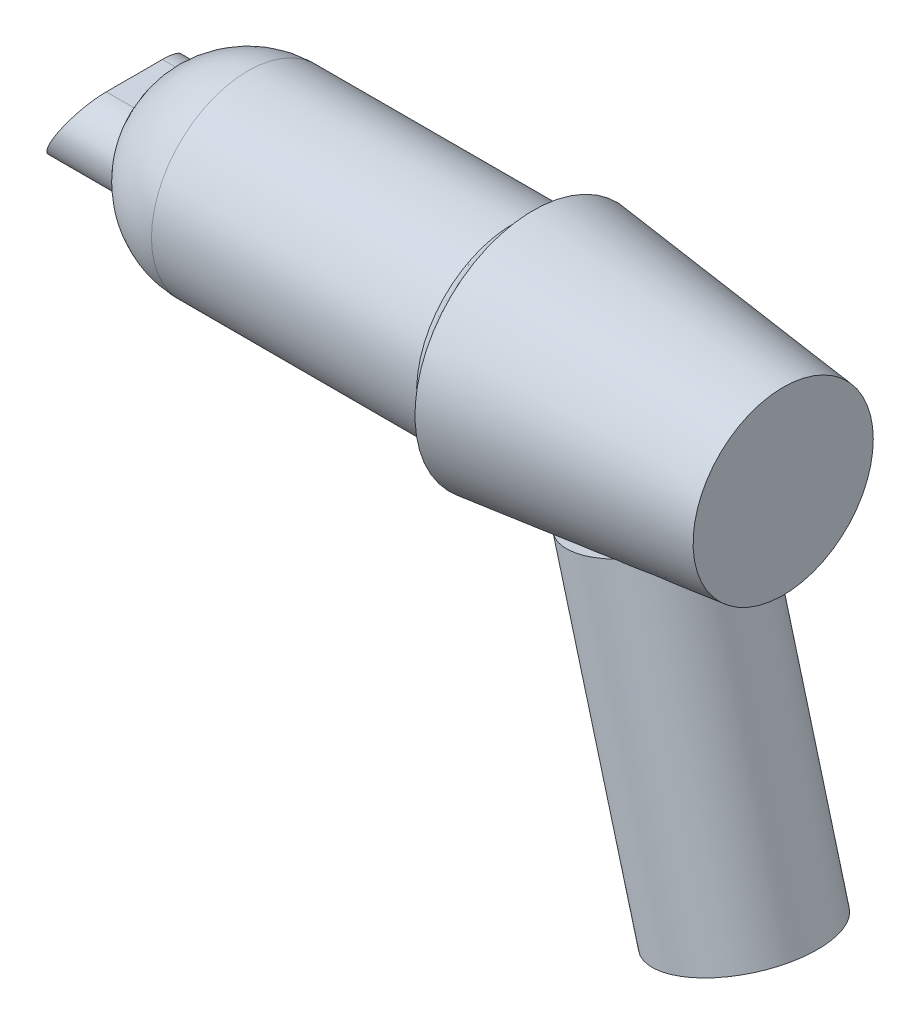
ISO-10303-21;
HEADER;
FILE_DESCRIPTION(('STEP AP214'),'2;1');
FILE_NAME('part.step','',(''),(''),'','','');
FILE_SCHEMA(('AUTOMOTIVE_DESIGN { 1 0 10303 214 1 1 1 1 }'));
ENDSEC;
DATA;
#1=APPLICATION_CONTEXT('core data for automotive mechanical design processes');
#2=APPLICATION_PROTOCOL_DEFINITION('international standard','automotive_design',2000,#1);
#3=PRODUCT_CONTEXT('',#1,'mechanical');
#4=PRODUCT('Part','Part','',(#3));
#5=PRODUCT_RELATED_PRODUCT_CATEGORY('part','',(#4));
#6=PRODUCT_DEFINITION_FORMATION('','',#4);
#7=PRODUCT_DEFINITION_CONTEXT('part definition',#1,'design');
#8=PRODUCT_DEFINITION('design','',#6,#7);
#9=PRODUCT_DEFINITION_SHAPE('','',#8);
#10=(LENGTH_UNIT() NAMED_UNIT(*) SI_UNIT(.MILLI.,.METRE.));
#11=(NAMED_UNIT(*) PLANE_ANGLE_UNIT() SI_UNIT($,.RADIAN.));
#12=(NAMED_UNIT(*) SI_UNIT($,.STERADIAN.) SOLID_ANGLE_UNIT());
#13=UNCERTAINTY_MEASURE_WITH_UNIT(LENGTH_MEASURE(1.E-05),#10,'distance_accuracy_value','');
#14=(GEOMETRIC_REPRESENTATION_CONTEXT(3) GLOBAL_UNCERTAINTY_ASSIGNED_CONTEXT((#13)) GLOBAL_UNIT_ASSIGNED_CONTEXT((#10,
#11,#12)) REPRESENTATION_CONTEXT('',''));
#15=CARTESIAN_POINT('',(0.,0.,0.));
#16=DIRECTION('',(0.,0.,1.));
#17=DIRECTION('',(1.,0.,0.));
#18=AXIS2_PLACEMENT_3D('',#15,#16,#17);
#19=CARTESIAN_POINT('',(-158.486,-26.67,0.));
#20=DIRECTION('',(0.,0.,-1.));
#21=DIRECTION('',(0.,-1.,0.));
#22=AXIS2_PLACEMENT_3D('',#19,#20,#21);
#23=SPHERICAL_SURFACE('',#22,28.5);
#24=CARTESIAN_POINT('',(-158.486,-26.67,0.));
#25=DIRECTION('',(1.,0.,0.));
#26=DIRECTION('',(0.,0.,1.));
#27=AXIS2_PLACEMENT_3D('',#24,#25,#26);
#28=CIRCLE('',#27,28.5);
#29=CARTESIAN_POINT('',(-158.486,-26.67,28.5));
#30=VERTEX_POINT('',#29);
#31=EDGE_CURVE('E226',#30,#30,#28,.T.);
#32=ORIENTED_EDGE('',*,*,#31,.F.);
#33=EDGE_LOOP('',(#32));
#34=FACE_BOUND('',#33,.T.);
#35=CARTESIAN_POINT('',(-183.64774318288,-16.1700000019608,-8.2998));
#36=CARTESIAN_POINT('',(-183.548723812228,-16.1699719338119,-8.59999776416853));
#37=CARTESIAN_POINT('',(-183.449311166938,-16.1832399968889,-8.90006090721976));
#38=CARTESIAN_POINT('',(-183.250400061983,-16.2361402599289,-9.4978304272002));
#39=CARTESIAN_POINT('',(-183.150901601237,-16.2757727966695,-9.79553677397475));
#40=CARTESIAN_POINT('',(-182.952450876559,-16.3812117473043,-10.3867097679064));
#41=CARTESIAN_POINT('',(-182.853499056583,-16.4470369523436,-10.6801732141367));
#42=CARTESIAN_POINT('',(-182.656953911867,-16.6044752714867,-11.2605616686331));
#43=CARTESIAN_POINT('',(-182.559360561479,-16.6960878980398,-11.5474868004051));
#44=CARTESIAN_POINT('',(-182.366220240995,-16.9046850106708,-12.1129654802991));
#45=CARTESIAN_POINT('',(-182.270674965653,-17.0216896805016,-12.3915121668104));
#46=CARTESIAN_POINT('',(-182.082513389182,-17.2803919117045,-12.9379302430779));
#47=CARTESIAN_POINT('',(-181.989897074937,-17.4220893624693,-13.2058016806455));
#48=CARTESIAN_POINT('',(-181.808467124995,-17.7293302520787,-13.7286958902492));
#49=CARTESIAN_POINT('',(-181.719651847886,-17.8948632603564,-13.9837242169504));
#50=CARTESIAN_POINT('',(-181.54664671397,-18.2488781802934,-14.4789989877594));
#51=CARTESIAN_POINT('',(-181.46245672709,-18.4373594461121,-14.7192458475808));
#52=CARTESIAN_POINT('',(-181.301385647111,-18.831749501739,-15.1778055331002));
#53=CARTESIAN_POINT('',(-181.224384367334,-19.0371826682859,-15.3964850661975));
#54=CARTESIAN_POINT('',(-181.076504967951,-19.4676639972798,-15.8158525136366));
#55=CARTESIAN_POINT('',(-181.005626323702,-19.6927104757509,-16.0165419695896));
#56=CARTESIAN_POINT('',(-180.870835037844,-20.1609619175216,-16.3980892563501));
#57=CARTESIAN_POINT('',(-180.806922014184,-20.4041658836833,-16.578948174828));
#58=CARTESIAN_POINT('',(-180.686886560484,-20.9070471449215,-16.9190643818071));
#59=CARTESIAN_POINT('',(-180.630763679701,-21.1667234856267,-17.0783229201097));
#60=CARTESIAN_POINT('',(-180.530062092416,-21.6853013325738,-17.3651142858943));
#61=CARTESIAN_POINT('',(-180.485006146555,-21.9433944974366,-17.4939421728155));
#62=CARTESIAN_POINT('',(-180.403108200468,-22.4706679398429,-17.7296655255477));
#63=CARTESIAN_POINT('',(-180.366265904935,-22.7398478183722,-17.8365617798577));
#64=CARTESIAN_POINT('',(-180.301325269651,-23.2871655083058,-18.0272854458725));
#65=CARTESIAN_POINT('',(-180.2732234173,-23.5652996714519,-18.1111221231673));
#66=CARTESIAN_POINT('',(-180.226157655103,-24.1284350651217,-18.2548892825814));
#67=CARTESIAN_POINT('',(-180.207193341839,-24.413435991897,-18.314820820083));
#68=CARTESIAN_POINT('',(-180.179527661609,-24.9710705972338,-18.4073300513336));
#69=CARTESIAN_POINT('',(-180.170288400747,-25.2434460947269,-18.4413089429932));
#70=CARTESIAN_POINT('',(-180.160284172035,-25.7901981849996,-18.4872018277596));
#71=CARTESIAN_POINT('',(-180.159518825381,-26.0645746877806,-18.4991168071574));
#72=CARTESIAN_POINT('',(-180.166472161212,-26.6132492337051,-18.5007884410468));
#73=CARTESIAN_POINT('',(-180.174189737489,-26.887547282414,-18.4905479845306));
#74=CARTESIAN_POINT('',(-180.198000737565,-27.4340645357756,-18.4480484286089));
#75=CARTESIAN_POINT('',(-180.214094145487,-27.7062837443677,-18.4157893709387));
#76=CARTESIAN_POINT('',(-180.253986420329,-28.2406013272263,-18.3305732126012));
#77=CARTESIAN_POINT('',(-180.277604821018,-28.502789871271,-18.2780953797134));
#78=CARTESIAN_POINT('',(-180.332339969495,-29.0214956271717,-18.152956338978));
#79=CARTESIAN_POINT('',(-180.363456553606,-29.2780129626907,-18.0802955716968));
#80=CARTESIAN_POINT('',(-180.432813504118,-29.7837165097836,-17.9154703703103));
#81=CARTESIAN_POINT('',(-180.471054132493,-30.0329024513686,-17.8233052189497));
#82=CARTESIAN_POINT('',(-180.554220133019,-30.5223961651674,-17.6202907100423));
#83=CARTESIAN_POINT('',(-180.599145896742,-30.7627034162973,-17.5094402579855));
#84=CARTESIAN_POINT('',(-180.696482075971,-31.2393238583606,-17.2667777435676));
#85=CARTESIAN_POINT('',(-180.749060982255,-31.4753568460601,-17.1344830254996));
#86=CARTESIAN_POINT('',(-180.860185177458,-31.9351680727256,-16.8522906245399));
#87=CARTESIAN_POINT('',(-180.918730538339,-32.1589461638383,-16.7023927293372));
#88=CARTESIAN_POINT('',(-181.041197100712,-32.5930012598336,-16.3861826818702));
#89=CARTESIAN_POINT('',(-181.105118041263,-32.8032789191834,-16.2198713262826));
#90=CARTESIAN_POINT('',(-181.237764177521,-33.2093202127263,-15.8720011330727));
#91=CARTESIAN_POINT('',(-181.306491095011,-33.4050785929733,-15.6904368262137));
#92=CARTESIAN_POINT('',(-181.452147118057,-33.7916863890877,-15.3026925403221));
#93=CARTESIAN_POINT('',(-181.529320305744,-33.9816302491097,-15.0957008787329));
#94=CARTESIAN_POINT('',(-181.68768466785,-34.3432247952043,-14.6675925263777));
#95=CARTESIAN_POINT('',(-181.768877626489,-34.514867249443,-14.4464695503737));
#96=CARTESIAN_POINT('',(-181.934601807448,-34.8389533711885,-13.9916453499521));
#97=CARTESIAN_POINT('',(-182.019134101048,-34.9913908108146,-13.757940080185));
#98=CARTESIAN_POINT('',(-182.190858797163,-35.276257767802,-13.2795661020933));
#99=CARTESIAN_POINT('',(-182.278051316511,-35.4086864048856,-13.0348969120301));
#100=CARTESIAN_POINT('',(-182.459509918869,-35.6598745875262,-12.5218939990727));
#101=CARTESIAN_POINT('',(-182.553895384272,-35.777419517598,-12.2530071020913));
#102=CARTESIAN_POINT('',(-182.744180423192,-35.9887447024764,-11.7066854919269));
#103=CARTESIAN_POINT('',(-182.840079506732,-36.0825324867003,-11.4292535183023));
#104=CARTESIAN_POINT('',(-183.032637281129,-36.2457882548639,-10.8679116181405));
#105=CARTESIAN_POINT('',(-183.129295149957,-36.3152796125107,-10.5840081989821));
#106=CARTESIAN_POINT('',(-183.322765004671,-36.4296256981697,-10.0114596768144));
#107=CARTESIAN_POINT('',(-183.419576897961,-36.474491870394,-9.72281684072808));
#108=CARTESIAN_POINT('',(-183.578781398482,-36.5279280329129,-9.24463882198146));
#109=CARTESIAN_POINT('',(-183.64131222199,-36.5437126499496,-9.05592617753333));
#110=CARTESIAN_POINT('',(-183.765914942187,-36.564742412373,-8.6781101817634));
#111=CARTESIAN_POINT('',(-183.827987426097,-36.5700049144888,-8.4890079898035));
#112=CARTESIAN_POINT('',(-183.889805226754,-36.5699999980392,-8.2998));
#113=B_SPLINE_CURVE_WITH_KNOTS('',3,(#35,#36,#37,#38,#39,#40,#41,#42,#43,#44,#45,#46,#47,#48,
#49,#50,#51,#52,#53,#54,#55,#56,#57,#58,#59,#60,#61,#62,#63,#64,#65,#66,#67,#68,#69,#70,#71,#72,
#73,#74,#75,#76,#77,#78,#79,#80,#81,#82,#83,#84,#85,#86,#87,#88,#89,#90,#91,#92,#93,#94,#95,#96,
#97,#98,#99,#100,#101,#102,#103,#104,#105,#106,#107,#108,#109,#110,#111,#112),.UNSPECIFIED.,.F.,
.F.,(4,2,2,2,2,2,2,2,2,2,2,2,2,2,2,2,2,2,2,2,2,2,2,2,2,2,2,2,2,2,2,2,2,2,2,2,2,2,4),(0.,
0.948035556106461,1.89608322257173,2.84481226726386,3.79352337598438,4.74299138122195,
5.69245513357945,6.64150465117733,7.59052746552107,8.51863515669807,9.44666324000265,
10.3746403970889,11.3025638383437,12.177312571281,13.0520298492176,13.9263951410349,
14.8007218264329,15.6236380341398,16.4465174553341,17.2692895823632,18.092060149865,
18.8964212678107,19.7007648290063,20.5051379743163,21.3095582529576,22.1355638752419,
22.9615794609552,23.7875549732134,24.6138279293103,25.4868857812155,26.3603346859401,
27.2340661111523,28.1078359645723,29.0315690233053,29.9550089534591,30.8775580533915,
31.7996780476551,32.3977047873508,32.9947442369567),.UNSPECIFIED.);
#114=CARTESIAN_POINT('',(-183.647677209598,-16.17,-8.3));
#115=VERTEX_POINT('',#114);
#116=CARTESIAN_POINT('',(-183.889739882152,-36.57,-8.3));
#117=VERTEX_POINT('',#116);
#118=EDGE_CURVE('E568',#115,#117,#113,.T.);
#119=ORIENTED_EDGE('',*,*,#118,.F.);
#120=CARTESIAN_POINT('',(-158.486,-16.17,0.));
#121=DIRECTION('',(0.,-1.,0.));
#122=DIRECTION('',(0.,0.,-1.));
#123=AXIS2_PLACEMENT_3D('',#120,#121,#122);
#124=CIRCLE('',#123,26.4952825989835);
#125=CARTESIAN_POINT('',(-183.647677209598,-16.17,8.3));
#126=VERTEX_POINT('',#125);
#127=EDGE_CURVE('E574',#126,#115,#124,.T.);
#128=ORIENTED_EDGE('',*,*,#127,.F.);
#129=CARTESIAN_POINT('',(-183.889805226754,-36.5699999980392,8.2998));
#130=CARTESIAN_POINT('',(-183.791368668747,-36.570028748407,8.60110335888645));
#131=CARTESIAN_POINT('',(-183.692264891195,-36.5566623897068,8.90217902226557));
#132=CARTESIAN_POINT('',(-183.493413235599,-36.5034217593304,9.50175561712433));
#133=CARTESIAN_POINT('',(-183.393665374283,-36.4635481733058,9.8002566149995));
#134=CARTESIAN_POINT('',(-183.194172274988,-36.357554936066,10.39269453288));
#135=CARTESIAN_POINT('',(-183.094427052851,-36.2914251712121,10.6866296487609));
#136=CARTESIAN_POINT('',(-182.895698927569,-36.1333589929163,11.2677398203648));
#137=CARTESIAN_POINT('',(-182.796716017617,-36.0414228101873,11.5549149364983));
#138=CARTESIAN_POINT('',(-182.600200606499,-35.8322326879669,12.1206223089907));
#139=CARTESIAN_POINT('',(-182.502669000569,-35.7149637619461,12.3991493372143));
#140=CARTESIAN_POINT('',(-182.30989666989,-35.4558206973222,12.9453451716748));
#141=CARTESIAN_POINT('',(-182.214655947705,-35.3139465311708,13.2130139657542));
#142=CARTESIAN_POINT('',(-182.027309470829,-35.0064582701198,13.7353852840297));
#143=CARTESIAN_POINT('',(-181.935202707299,-34.8408519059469,13.990091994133));
#144=CARTESIAN_POINT('',(-181.754938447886,-34.4868292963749,14.4846219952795));
#145=CARTESIAN_POINT('',(-181.666780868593,-34.2984135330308,14.724445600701));
#146=CARTESIAN_POINT('',(-181.496664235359,-33.9030958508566,15.1835126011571));
#147=CARTESIAN_POINT('',(-181.414628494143,-33.6965385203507,15.4030241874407));
#148=CARTESIAN_POINT('',(-181.256087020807,-33.2636945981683,15.823833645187));
#149=CARTESIAN_POINT('',(-181.179580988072,-33.0374090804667,16.0251325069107));
#150=CARTESIAN_POINT('',(-181.032966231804,-32.5665631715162,16.4076884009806));
#151=CARTESIAN_POINT('',(-180.962857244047,-32.3220035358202,16.5889462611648));
#152=CARTESIAN_POINT('',(-180.82990046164,-31.8162802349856,16.929656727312));
#153=CARTESIAN_POINT('',(-180.767052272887,-31.5551174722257,17.0891105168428));
#154=CARTESIAN_POINT('',(-180.652553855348,-31.0322502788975,17.3767677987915));
#155=CARTESIAN_POINT('',(-180.600488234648,-30.7712985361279,17.5061747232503));
#156=CARTESIAN_POINT('',(-180.504300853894,-30.2380583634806,17.7426251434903));
#157=CARTESIAN_POINT('',(-180.460178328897,-29.9657710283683,17.8496707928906));
#158=CARTESIAN_POINT('',(-180.380495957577,-29.4119783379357,18.0402302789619));
#159=CARTESIAN_POINT('',(-180.344932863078,-29.1304765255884,18.1237530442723));
#160=CARTESIAN_POINT('',(-180.28286693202,-28.5603752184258,18.2663724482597));
#161=CARTESIAN_POINT('',(-180.256363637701,-28.2717760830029,18.3254703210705));
#162=CARTESIAN_POINT('',(-180.214164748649,-27.7078444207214,18.415661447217));
#163=CARTESIAN_POINT('',(-180.197902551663,-27.4327939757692,18.4482594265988));
#164=CARTESIAN_POINT('',(-180.173929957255,-26.8805870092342,18.4909753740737));
#165=CARTESIAN_POINT('',(-180.166219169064,-26.60343058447,18.5010943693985));
#166=CARTESIAN_POINT('',(-180.159458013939,-26.0491594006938,18.4987183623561));
#167=CARTESIAN_POINT('',(-180.160406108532,-25.7720446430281,18.4862273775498));
#168=CARTESIAN_POINT('',(-180.170945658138,-25.2199169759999,18.4387415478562));
#169=CARTESIAN_POINT('',(-180.18053702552,-24.9449040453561,18.4037469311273));
#170=CARTESIAN_POINT('',(-180.207786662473,-24.4077492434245,18.3130609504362));
#171=CARTESIAN_POINT('',(-180.225178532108,-24.1454762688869,18.2580635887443));
#172=CARTESIAN_POINT('',(-180.267711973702,-23.6266654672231,18.1277996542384));
#173=CARTESIAN_POINT('',(-180.292853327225,-23.3701274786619,18.0525336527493));
#174=CARTESIAN_POINT('',(-180.350572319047,-22.8644934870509,17.8824099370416));
#175=CARTESIAN_POINT('',(-180.383150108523,-22.6153976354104,17.7875518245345));
#176=CARTESIAN_POINT('',(-180.455351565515,-22.126244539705,17.5790747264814));
#177=CARTESIAN_POINT('',(-180.494975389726,-21.8861874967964,17.4654553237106));
#178=CARTESIAN_POINT('',(-180.581579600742,-21.4124068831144,17.2182357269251));
#179=CARTESIAN_POINT('',(-180.628678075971,-21.1788713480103,17.0843166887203));
#180=CARTESIAN_POINT('',(-180.729180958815,-20.7240706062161,16.7991486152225));
#181=CARTESIAN_POINT('',(-180.782585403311,-20.5028054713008,16.6478994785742));
#182=CARTESIAN_POINT('',(-180.89513900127,-20.0737978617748,16.3292730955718));
#183=CARTESIAN_POINT('',(-180.954287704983,-19.8660543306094,16.1618971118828));
#184=CARTESIAN_POINT('',(-181.07778053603,-19.465086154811,15.8121877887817));
#185=CARTESIAN_POINT('',(-181.142126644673,-19.271867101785,15.6298487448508));
#186=CARTESIAN_POINT('',(-181.278946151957,-18.8911562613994,15.2415193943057));
#187=CARTESIAN_POINT('',(-181.351669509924,-18.7045099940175,15.034787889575));
#188=CARTESIAN_POINT('',(-181.501565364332,-18.3493552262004,14.6076496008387));
#189=CARTESIAN_POINT('',(-181.578739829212,-18.180854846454,14.3872367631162));
#190=CARTESIAN_POINT('',(-181.736868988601,-17.8628572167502,13.9342805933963));
#191=CARTESIAN_POINT('',(-181.817824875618,-17.7133660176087,13.701733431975));
#192=CARTESIAN_POINT('',(-181.982847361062,-17.4341467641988,13.2261121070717));
#193=CARTESIAN_POINT('',(-182.066914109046,-17.3044196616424,12.9830374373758));
#194=CARTESIAN_POINT('',(-182.242626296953,-17.0581825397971,12.4731196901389));
#195=CARTESIAN_POINT('',(-182.334424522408,-16.9429244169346,12.2057240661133));
#196=CARTESIAN_POINT('',(-182.520056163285,-16.7358919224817,11.6627886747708));
#197=CARTESIAN_POINT('',(-182.61388893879,-16.6441102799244,11.3872514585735));
#198=CARTESIAN_POINT('',(-182.802836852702,-16.4845216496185,10.8300648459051));
#199=CARTESIAN_POINT('',(-182.897950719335,-16.4166924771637,10.5484213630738));
#200=CARTESIAN_POINT('',(-183.088849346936,-16.305270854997,9.98072714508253));
#201=CARTESIAN_POINT('',(-183.184633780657,-16.2616673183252,9.6946784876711));
#202=CARTESIAN_POINT('',(-183.341789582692,-16.2101918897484,9.22334980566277));
#203=CARTESIAN_POINT('',(-183.403149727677,-16.1951093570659,9.03882316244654));
#204=CARTESIAN_POINT('',(-183.525634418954,-16.1750195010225,8.6694862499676));
#205=CARTESIAN_POINT('',(-183.586759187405,-16.1699954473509,8.48467696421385));
#206=CARTESIAN_POINT('',(-183.64774318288,-16.1700000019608,8.29980000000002));
#207=B_SPLINE_CURVE_WITH_KNOTS('',3,(#129,#130,#131,#132,#133,#134,#135,#136,#137,#138,#139,
#140,#141,#142,#143,#144,#145,#146,#147,#148,#149,#150,#151,#152,#153,#154,#155,#156,#157,#158,
#159,#160,#161,#162,#163,#164,#165,#166,#167,#168,#169,#170,#171,#172,#173,#174,#175,#176,#177,
#178,#179,#180,#181,#182,#183,#184,#185,#186,#187,#188,#189,#190,#191,#192,#193,#194,#195,#196,
#197,#198,#199,#200,#201,#202,#203,#204,#205,#206),.UNSPECIFIED.,.F.,.F.,(4,2,2,2,2,2,2,2,2,2,2,
2,2,2,2,2,2,2,2,2,2,2,2,2,2,2,2,2,2,2,2,2,2,2,2,2,2,2,4),(0.,0.95063094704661,1.90123730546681,
2.8522101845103,3.80317456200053,4.75470306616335,5.70623263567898,6.65745294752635,
7.60865315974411,8.54461184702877,9.48051961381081,10.4163887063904,11.3522069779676,
12.2387470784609,13.1252017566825,14.0113195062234,14.8973924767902,15.7287168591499,
16.5600032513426,17.3911419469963,18.2222722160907,19.0269559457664,19.8316169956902,
20.6362944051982,21.4409897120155,22.2599674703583,23.0789500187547,23.8978684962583,
24.7171006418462,25.5797277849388,26.4427393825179,27.3060250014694,28.1693521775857,
29.0842343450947,29.998832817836,30.9125819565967,31.8259125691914,32.410807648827,
32.9947290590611),.UNSPECIFIED.);
#208=CARTESIAN_POINT('',(-183.889739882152,-36.57,8.30000000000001));
#209=VERTEX_POINT('',#208);
#210=EDGE_CURVE('E187',#209,#126,#207,.T.);
#211=ORIENTED_EDGE('',*,*,#210,.F.);
#212=CARTESIAN_POINT('',(-158.486,-36.57,0.));
#213=DIRECTION('',(0.,1.,0.));
#214=DIRECTION('',(0.,0.,1.));
#215=AXIS2_PLACEMENT_3D('',#212,#213,#214);
#216=CIRCLE('',#215,26.7252689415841);
#217=EDGE_CURVE('E196',#117,#209,#216,.T.);
#218=ORIENTED_EDGE('',*,*,#217,.F.);
#219=EDGE_LOOP('',(#119,#128,#211,#218));
#220=FACE_BOUND('',#219,.T.);
#221=ADVANCED_FACE('F51',(#34,#220),#23,.T.);
#222=CARTESIAN_POINT('',(0.,-26.67,0.));
#223=DIRECTION('',(1.,0.,0.));
#224=DIRECTION('',(0.,0.,-1.));
#225=AXIS2_PLACEMENT_3D('',#222,#223,#224);
#226=PLANE('',#225);
#227=CARTESIAN_POINT('',(0.,-26.67,0.));
#228=DIRECTION('',(1.,0.,0.));
#229=DIRECTION('',(0.,0.,-1.));
#230=AXIS2_PLACEMENT_3D('',#227,#228,#229);
#231=CIRCLE('',#230,26.67);
#232=CARTESIAN_POINT('',(0.,-26.67,-26.67));
#233=VERTEX_POINT('',#232);
#234=EDGE_CURVE('E283',#233,#233,#231,.T.);
#235=ORIENTED_EDGE('',*,*,#234,.T.);
#236=EDGE_LOOP('',(#235));
#237=FACE_BOUND('',#236,.T.);
#238=ADVANCED_FACE('F53',(#237),#226,.T.);
#239=CARTESIAN_POINT('',(0.,-26.67,0.));
#240=DIRECTION('',(-1.,0.,0.));
#241=DIRECTION('',(0.,0.,1.));
#242=AXIS2_PLACEMENT_3D('',#239,#240,#241);
#243=CONICAL_SURFACE('',#242,26.67,0.112095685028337);
#244=CARTESIAN_POINT('',(11.2621844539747,-37.3416826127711,0.));
#245=DIRECTION('',(-0.258819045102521,0.965925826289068,0.));
#246=DIRECTION('',(-0.965925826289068,-0.258819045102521,0.));
#247=AXIS2_PLACEMENT_3D('',#244,#245,#246);
#248=ELLIPSE('',#247,98.1467313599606,23.0518796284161);
#249=CARTESIAN_POINT('',(-50.6524205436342,-53.9316510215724,-17.456720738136));
#250=VERTEX_POINT('',#249);
#251=CARTESIAN_POINT('',(-28.8574595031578,-48.0917088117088,-20.88592562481));
#252=VERTEX_POINT('',#251);
#253=EDGE_CURVE('E12',#250,#252,#248,.F.);
#254=ORIENTED_EDGE('',*,*,#253,.F.);
#255=CARTESIAN_POINT('',(-53.448858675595,-56.1163973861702,-14.1888697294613));
#256=CARTESIAN_POINT('',(-53.104771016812,-55.8327713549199,-14.6882467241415));
#257=CARTESIAN_POINT('',(-52.7420958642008,-55.5389615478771,-15.1691899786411));
#258=CARTESIAN_POINT('',(-51.9808488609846,-54.9363464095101,-16.0920640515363));
#259=CARTESIAN_POINT('',(-51.582257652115,-54.6275330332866,-16.5339735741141));
#260=CARTESIAN_POINT('',(-50.748702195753,-53.9997278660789,-17.3780857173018));
#261=CARTESIAN_POINT('',(-50.3136149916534,-53.6807041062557,-17.7801432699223));
#262=CARTESIAN_POINT('',(-49.4088048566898,-53.0400159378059,-18.5407025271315));
#263=CARTESIAN_POINT('',(-48.939086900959,-52.7183519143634,-18.8992104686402));
#264=CARTESIAN_POINT('',(-47.9622200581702,-52.0777143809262,-19.5724883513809));
#265=CARTESIAN_POINT('',(-47.4548686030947,-51.7587675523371,-19.8869906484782));
#266=CARTESIAN_POINT('',(-46.4051021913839,-51.1338923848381,-20.4671683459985));
#267=CARTESIAN_POINT('',(-45.8626809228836,-50.8279664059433,-20.7328349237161));
#268=CARTESIAN_POINT('',(-44.7453881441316,-50.2400344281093,-21.2112922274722));
#269=CARTESIAN_POINT('',(-44.1706413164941,-49.9579457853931,-21.4242710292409));
#270=CARTESIAN_POINT('',(-42.988826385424,-49.4274336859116,-21.7950928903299));
#271=CARTESIAN_POINT('',(-42.3817797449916,-49.1789882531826,-21.9529720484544));
#272=CARTESIAN_POINT('',(-41.3400079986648,-48.7998564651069,-22.1689578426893));
#273=CARTESIAN_POINT('',(-40.912895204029,-48.6570422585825,-22.2428202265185));
#274=CARTESIAN_POINT('',(-40.0477032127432,-48.3950878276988,-22.363166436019));
#275=CARTESIAN_POINT('',(-39.6096262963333,-48.2759427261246,-22.4096559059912));
#276=CARTESIAN_POINT('',(-38.7255293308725,-48.0640017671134,-22.4748790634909));
#277=CARTESIAN_POINT('',(-38.2795170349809,-47.971181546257,-22.4936384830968));
#278=CARTESIAN_POINT('',(-37.3822639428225,-47.8133913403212,-22.5036328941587));
#279=CARTESIAN_POINT('',(-36.9310229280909,-47.7484225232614,-22.4948667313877));
#280=CARTESIAN_POINT('',(-36.0273933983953,-47.6469433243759,-22.4505158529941));
#281=CARTESIAN_POINT('',(-35.5750077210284,-47.610389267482,-22.414972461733));
#282=CARTESIAN_POINT('',(-34.6716412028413,-47.5649377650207,-22.318247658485));
#283=CARTESIAN_POINT('',(-34.2206603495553,-47.5560400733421,-22.2570664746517));
#284=CARTESIAN_POINT('',(-33.3223705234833,-47.5642862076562,-22.110404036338));
#285=CARTESIAN_POINT('',(-32.875066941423,-47.5814631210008,-22.0248920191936));
#286=CARTESIAN_POINT('',(-31.9869964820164,-47.6395874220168,-21.8311533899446));
#287=CARTESIAN_POINT('',(-31.5462305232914,-47.6805381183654,-21.7229236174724));
#288=CARTESIAN_POINT('',(-30.474045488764,-47.8069704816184,-21.4311085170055));
#289=CARTESIAN_POINT('',(-29.8472205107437,-47.9042390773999,-21.2356527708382));
#290=CARTESIAN_POINT('',(-28.6145971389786,-48.1346822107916,-20.8038159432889));
#291=CARTESIAN_POINT('',(-28.0088089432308,-48.267873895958,-20.567415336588));
#292=CARTESIAN_POINT('',(-26.8192593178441,-48.5621471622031,-20.0562208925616));
#293=CARTESIAN_POINT('',(-26.2355448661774,-48.7232845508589,-19.7813504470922));
#294=CARTESIAN_POINT('',(-25.0928412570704,-49.065819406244,-19.19562514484));
#295=CARTESIAN_POINT('',(-24.5338490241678,-49.2472143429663,-18.884774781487));
#296=CARTESIAN_POINT('',(-23.4192423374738,-49.6315095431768,-18.214728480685));
#297=CARTESIAN_POINT('',(-22.8647049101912,-49.834986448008,-17.8540734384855));
#298=CARTESIAN_POINT('',(-21.7850565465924,-50.2504335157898,-17.0954486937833));
#299=CARTESIAN_POINT('',(-21.2599479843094,-50.4624043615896,-16.6974759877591));
#300=CARTESIAN_POINT('',(-20.2417761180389,-50.8887754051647,-15.8646114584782));
#301=CARTESIAN_POINT('',(-19.748683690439,-51.1031731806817,-15.429754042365));
#302=CARTESIAN_POINT('',(-18.7969298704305,-51.5290608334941,-14.5225595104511));
#303=CARTESIAN_POINT('',(-18.3382636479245,-51.7405511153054,-14.0502276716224));
#304=CARTESIAN_POINT('',(-17.5139253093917,-52.1293690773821,-13.1290519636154));
#305=CARTESIAN_POINT('',(-17.1437875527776,-52.3076695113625,-12.6846169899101));
#306=CARTESIAN_POINT('',(-16.4359310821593,-52.6542257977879,-11.7668219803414));
#307=CARTESIAN_POINT('',(-16.0982124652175,-52.8224816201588,-11.2934618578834));
#308=CARTESIAN_POINT('',(-15.4593019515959,-53.1449850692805,-10.318792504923));
#309=CARTESIAN_POINT('',(-15.1580747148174,-53.2992462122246,-9.81751101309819));
#310=CARTESIAN_POINT('',(-14.5961103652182,-53.5900313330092,-8.78781041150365));
#311=CARTESIAN_POINT('',(-14.33536444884,-53.7265591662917,-8.25939723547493));
#312=CARTESIAN_POINT('',(-13.9037004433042,-53.9543898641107,-7.27917183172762));
#313=CARTESIAN_POINT('',(-13.7251074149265,-54.0493719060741,-6.83158811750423));
#314=CARTESIAN_POINT('',(-13.4002122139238,-54.2230528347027,-5.92175655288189));
#315=CARTESIAN_POINT('',(-13.2539065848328,-54.3017534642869,-5.45951027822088));
#316=CARTESIAN_POINT('',(-12.9960380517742,-54.44098929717,-4.52302482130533));
#317=CARTESIAN_POINT('',(-12.8844534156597,-54.5015358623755,-4.04879334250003));
#318=CARTESIAN_POINT('',(-12.697935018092,-54.6029905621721,-3.09106465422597));
#319=CARTESIAN_POINT('',(-12.623001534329,-54.64389854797,-2.60756737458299));
#320=CARTESIAN_POINT('',(-12.5110298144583,-54.7050987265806,-1.63270169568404));
#321=CARTESIAN_POINT('',(-12.4741611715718,-54.7252986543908,-1.14130789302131));
#322=CARTESIAN_POINT('',(-12.439686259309,-54.74418563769,-0.156723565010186));
#323=CARTESIAN_POINT('',(-12.442080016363,-54.7428726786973,0.336466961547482));
#324=CARTESIAN_POINT('',(-12.4860790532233,-54.7187715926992,1.3205906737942));
#325=CARTESIAN_POINT('',(-12.5276871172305,-54.6959819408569,1.81152369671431));
#326=CARTESIAN_POINT('',(-12.6492455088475,-54.6295720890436,2.78716438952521));
#327=CARTESIAN_POINT('',(-12.7291951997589,-54.5859522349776,3.27187216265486));
#328=CARTESIAN_POINT('',(-12.9194870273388,-54.4825271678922,4.2005210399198));
#329=CARTESIAN_POINT('',(-13.0275339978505,-54.4239485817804,4.64507388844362));
#330=CARTESIAN_POINT('',(-13.2740458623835,-54.2909218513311,5.52316554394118));
#331=CARTESIAN_POINT('',(-13.412508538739,-54.2164748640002,5.95670515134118));
#332=CARTESIAN_POINT('',(-13.7179287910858,-54.0532141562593,6.81096212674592));
#333=CARTESIAN_POINT('',(-13.8848950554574,-53.9643960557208,7.23167553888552));
#334=CARTESIAN_POINT('',(-14.2452227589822,-53.7740680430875,8.05871511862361));
#335=CARTESIAN_POINT('',(-14.4385899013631,-53.6725553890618,8.46503815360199));
#336=CARTESIAN_POINT('',(-14.9382037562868,-53.4124577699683,9.43393745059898));
#337=CARTESIAN_POINT('',(-15.257197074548,-53.2481229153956,9.98843609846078));
#338=CARTESIAN_POINT('',(-15.9392673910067,-52.9020608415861,11.0639137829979));
#339=CARTESIAN_POINT('',(-16.3023611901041,-52.7203269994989,11.5848799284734));
#340=CARTESIAN_POINT('',(-17.0681749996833,-52.3441506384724,12.5932482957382));
#341=CARTESIAN_POINT('',(-17.4709579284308,-52.1496881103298,13.0805950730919));
#342=CARTESIAN_POINT('',(-18.3114204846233,-51.7531607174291,14.020665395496));
#343=CARTESIAN_POINT('',(-18.7490969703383,-51.5510965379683,14.4733920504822));
#344=CARTESIAN_POINT('',(-19.6667340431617,-51.1392889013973,15.3547811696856));
#345=CARTESIAN_POINT('',(-20.1474477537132,-50.9294766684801,15.7826256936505));
#346=CARTESIAN_POINT('',(-21.1392727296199,-50.5119724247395,16.6026495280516));
#347=CARTESIAN_POINT('',(-21.6503861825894,-50.3042805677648,16.994826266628));
#348=CARTESIAN_POINT('',(-22.7009461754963,-49.8964787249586,17.7435144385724));
#349=CARTESIAN_POINT('',(-23.24039201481,-49.6963685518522,18.1000267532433));
#350=CARTESIAN_POINT('',(-24.3461054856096,-49.3097071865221,18.7769536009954));
#351=CARTESIAN_POINT('',(-24.9123702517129,-49.1231545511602,19.0973719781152));
#352=CARTESIAN_POINT('',(-26.0047893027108,-48.79037979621,19.6667600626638));
#353=CARTESIAN_POINT('',(-26.5282041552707,-48.6419833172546,19.9197115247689));
#354=CARTESIAN_POINT('',(-27.5943069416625,-48.3664912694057,20.3950399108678));
#355=CARTESIAN_POINT('',(-28.1369955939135,-48.2393964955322,20.6174156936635));
#356=CARTESIAN_POINT('',(-29.2394163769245,-48.0126694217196,21.0292154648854));
#357=CARTESIAN_POINT('',(-29.7991203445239,-47.9129942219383,21.2186907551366));
#358=CARTESIAN_POINT('',(-30.9341541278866,-47.7472774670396,21.5623497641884));
#359=CARTESIAN_POINT('',(-31.5094790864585,-47.6812255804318,21.7165443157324));
#360=CARTESIAN_POINT('',(-32.5442303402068,-47.5992104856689,21.9566507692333));
#361=CARTESIAN_POINT('',(-33.001286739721,-47.5754213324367,22.0501219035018));
#362=CARTESIAN_POINT('',(-33.9204566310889,-47.5547558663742,22.2119357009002));
#363=CARTESIAN_POINT('',(-34.3825694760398,-47.5578761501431,22.2802815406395));
#364=CARTESIAN_POINT('',(-35.3083762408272,-47.5929536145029,22.3901944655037));
#365=CARTESIAN_POINT('',(-35.7720676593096,-47.6248768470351,22.4317929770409));
#366=CARTESIAN_POINT('',(-36.6981538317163,-47.7184198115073,22.4870455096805));
#367=CARTESIAN_POINT('',(-37.160548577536,-47.7800397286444,22.5006993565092));
#368=CARTESIAN_POINT('',(-38.081355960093,-47.9327846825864,22.4992439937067));
#369=CARTESIAN_POINT('',(-38.5397586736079,-48.0239690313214,22.4840766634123));
#370=CARTESIAN_POINT('',(-39.4481865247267,-48.2341826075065,22.4246268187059));
#371=CARTESIAN_POINT('',(-39.8982116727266,-48.3532118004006,22.3803443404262));
#372=CARTESIAN_POINT('',(-40.787555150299,-48.6166098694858,22.262905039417));
#373=CARTESIAN_POINT('',(-41.2268584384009,-48.7610122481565,22.1897098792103));
#374=CARTESIAN_POINT('',(-42.0919307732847,-49.0716590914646,22.0152031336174));
#375=CARTESIAN_POINT('',(-42.5176980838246,-49.2379063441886,21.9138879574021));
#376=CARTESIAN_POINT('',(-43.4530135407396,-49.6299700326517,21.6569948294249));
#377=CARTESIAN_POINT('',(-43.9585902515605,-49.8605806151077,21.4942520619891));
#378=CARTESIAN_POINT('',(-44.9450847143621,-50.3424886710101,21.129451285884));
#379=CARTESIAN_POINT('',(-45.4259961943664,-50.5937913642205,20.9273833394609));
#380=CARTESIAN_POINT('',(-46.3628713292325,-51.1107410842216,20.4858130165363));
#381=CARTESIAN_POINT('',(-46.8188099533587,-51.3764019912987,20.2462739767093));
#382=CARTESIAN_POINT('',(-47.7050143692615,-51.9159287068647,19.731790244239));
#383=CARTESIAN_POINT('',(-48.1352813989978,-52.18979411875,19.4568472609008));
#384=CARTESIAN_POINT('',(-48.9778853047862,-52.7456295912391,18.867762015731));
#385=CARTESIAN_POINT('',(-49.389743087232,-53.0276558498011,18.5529885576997));
#386=CARTESIAN_POINT('',(-50.1867558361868,-53.5899296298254,17.8898868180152));
#387=CARTESIAN_POINT('',(-50.5719109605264,-53.8701771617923,17.5415587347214));
#388=CARTESIAN_POINT('',(-51.3152492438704,-54.4244876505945,16.8127116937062));
#389=CARTESIAN_POINT('',(-51.6734331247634,-54.6985507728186,16.4321935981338));
#390=CARTESIAN_POINT('',(-52.3623358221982,-55.2364710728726,15.6402721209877));
#391=CARTESIAN_POINT('',(-52.6930521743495,-55.5003273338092,15.2288659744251));
#392=CARTESIAN_POINT('',(-53.3787177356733,-56.0566351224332,14.3058913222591));
#393=CARTESIAN_POINT('',(-53.7286000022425,-56.3465789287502,13.7890225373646));
#394=CARTESIAN_POINT('',(-54.3882857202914,-56.9018001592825,12.7176899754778));
#395=CARTESIAN_POINT('',(-54.698084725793,-57.1670748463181,12.1632220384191));
#396=CARTESIAN_POINT('',(-55.2754996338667,-57.667595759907,11.0198054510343));
#397=CARTESIAN_POINT('',(-55.5431178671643,-57.9028436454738,10.4308587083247));
#398=CARTESIAN_POINT('',(-56.0338661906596,-58.3383290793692,9.22227944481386));
#399=CARTESIAN_POINT('',(-56.2570013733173,-58.5385706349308,8.6026504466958));
#400=CARTESIAN_POINT('',(-56.6438593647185,-58.8881813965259,7.37724508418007));
#401=CARTESIAN_POINT('',(-56.8104418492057,-59.0399627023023,6.77306007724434));
#402=CARTESIAN_POINT('',(-57.1007305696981,-59.3057029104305,5.54630620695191));
#403=CARTESIAN_POINT('',(-57.2244380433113,-59.4196629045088,4.92373787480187));
#404=CARTESIAN_POINT('',(-57.4273987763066,-59.6071756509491,3.6659153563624));
#405=CARTESIAN_POINT('',(-57.5066881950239,-59.680761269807,3.03067192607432));
#406=CARTESIAN_POINT('',(-57.6199247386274,-59.785979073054,1.75272984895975));
#407=CARTESIAN_POINT('',(-57.6538763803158,-59.8176154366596,1.11003195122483));
#408=CARTESIAN_POINT('',(-57.6748018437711,-59.8371080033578,-0.107245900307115));
#409=CARTESIAN_POINT('',(-57.6664539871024,-59.8293241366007,-0.681684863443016));
#410=CARTESIAN_POINT('',(-57.6134366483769,-59.7799705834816,-1.82739322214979));
#411=CARTESIAN_POINT('',(-57.5687700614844,-59.7384035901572,-2.39866286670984));
#412=CARTESIAN_POINT('',(-57.4435768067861,-59.6222341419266,-3.53401817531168));
#413=CARTESIAN_POINT('',(-57.3630394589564,-59.5476218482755,-4.09810164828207));
#414=CARTESIAN_POINT('',(-57.1669258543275,-59.3667051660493,-5.2149588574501));
#415=CARTESIAN_POINT('',(-57.0513497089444,-59.2604008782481,-5.76773262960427));
#416=CARTESIAN_POINT('',(-56.7882240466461,-59.0197503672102,-6.85025986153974));
#417=CARTESIAN_POINT('',(-56.6411746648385,-58.8858438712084,-7.38023324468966));
#418=CARTESIAN_POINT('',(-56.3153382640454,-58.591213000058,-8.42269858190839));
#419=CARTESIAN_POINT('',(-56.136548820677,-58.4304865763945,-8.93518919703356));
#420=CARTESIAN_POINT('',(-55.7487834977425,-58.0849030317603,-9.93938361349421));
#421=CARTESIAN_POINT('',(-55.5398448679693,-57.9000757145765,-10.4311121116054));
#422=CARTESIAN_POINT('',(-55.0929664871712,-57.5088719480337,-11.3920930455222));
#423=CARTESIAN_POINT('',(-54.8550362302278,-57.3025025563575,-11.8613527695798));
#424=CARTESIAN_POINT('',(-54.4245351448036,-56.9337347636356,-12.6428230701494));
#425=CARTESIAN_POINT('',(-54.2388603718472,-56.7759734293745,-12.9610629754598));
#426=CARTESIAN_POINT('',(-53.8539584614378,-56.452153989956,-13.5846888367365));
#427=CARTESIAN_POINT('',(-53.6547356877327,-56.2860985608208,-13.8900788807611));
#428=CARTESIAN_POINT('',(-53.448858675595,-56.1163973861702,-14.1888697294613));
#429=B_SPLINE_CURVE_WITH_KNOTS('',3,(#255,#256,#257,#258,#259,#260,#261,#262,#263,#264,#265,
#266,#267,#268,#269,#270,#271,#272,#273,#274,#275,#276,#277,#278,#279,#280,#281,#282,#283,#284,
#285,#286,#287,#288,#289,#290,#291,#292,#293,#294,#295,#296,#297,#298,#299,#300,#301,#302,#303,
#304,#305,#306,#307,#308,#309,#310,#311,#312,#313,#314,#315,#316,#317,#318,#319,#320,#321,#322,
#323,#324,#325,#326,#327,#328,#329,#330,#331,#332,#333,#334,#335,#336,#337,#338,#339,#340,#341,
#342,#343,#344,#345,#346,#347,#348,#349,#350,#351,#352,#353,#354,#355,#356,#357,#358,#359,#360,
#361,#362,#363,#364,#365,#366,#367,#368,#369,#370,#371,#372,#373,#374,#375,#376,#377,#378,#379,
#380,#381,#382,#383,#384,#385,#386,#387,#388,#389,#390,#391,#392,#393,#394,#395,#396,#397,#398,
#399,#400,#401,#402,#403,#404,#405,#406,#407,#408,#409,#410,#411,#412,#413,#414,#415,#416,#417,
#418,#419,#420,#421,#422,#423,#424,#425,#426,#427,#428),.UNSPECIFIED.,.T.,.F.,(4,2,2,2,2,2,2,2,
2,2,2,2,2,2,2,2,2,2,2,2,2,2,2,2,2,2,2,2,2,2,2,2,2,2,2,2,2,2,2,2,2,2,2,2,2,2,2,2,2,2,2,2,2,2,2,2,
2,2,2,2,2,2,2,2,2,2,2,2,2,2,2,2,2,2,2,2,2,2,2,2,2,2,2,2,2,2,4),(0.,2.00811715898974,
4.01732321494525,6.03359342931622,8.04957454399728,10.0773284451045,12.1054483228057,
14.1262205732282,16.1456664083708,17.5133865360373,18.8808245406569,20.246992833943,
21.613218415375,22.9773398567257,24.3414491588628,25.7072908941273,27.0733227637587,
29.0614937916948,31.0506155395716,33.0437562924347,35.036648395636,37.1112033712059,
39.1859254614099,41.2587330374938,43.3312492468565,45.1454756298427,46.9597074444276,
48.7721679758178,50.584233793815,52.0563262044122,53.528260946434,54.9992725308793,
56.4702952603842,57.9478440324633,59.4253937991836,60.9030484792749,62.3806786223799,
63.7629202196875,65.145061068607,66.5276239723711,67.9104860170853,69.8889606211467,
71.8681913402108,73.8506117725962,75.8328539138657,77.8617841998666,79.8908606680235,
81.9198869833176,83.9486970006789,85.7473011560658,87.5459724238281,89.3418133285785,
91.1371020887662,92.5371413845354,93.9370036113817,95.335218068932,96.7334412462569,
98.1344870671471,99.5355311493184,100.938439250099,102.341526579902,104.076103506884,
105.811119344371,107.547843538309,109.284483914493,111.053258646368,112.82202292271,
114.590739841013,116.359615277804,118.421635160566,120.483883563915,122.546017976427,
124.607916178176,126.539761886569,128.471551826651,130.401766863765,132.331789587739,
134.053334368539,135.774741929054,137.496662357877,139.218577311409,140.914929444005,
142.611411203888,144.305814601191,145.999664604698,147.201561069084,148.403072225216),.UNSPECIFIED.);
#430=CARTESIAN_POINT('',(-50.6524205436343,-53.9316510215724,17.4567207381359));
#431=VERTEX_POINT('',#430);
#432=EDGE_CURVE('E56',#431,#250,#429,.T.);
#433=ORIENTED_EDGE('',*,*,#432,.F.);
#434=CARTESIAN_POINT('',(-28.8574595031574,-48.0917088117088,20.8859256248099));
#435=VERTEX_POINT('',#434);
#436=EDGE_CURVE('E67',#435,#431,#248,.F.);
#437=ORIENTED_EDGE('',*,*,#436,.F.);
#438=EDGE_CURVE('E66',#252,#435,#429,.T.);
#439=ORIENTED_EDGE('',*,*,#438,.F.);
#440=EDGE_LOOP('',(#254,#433,#437,#439));
#441=FACE_BOUND('',#440,.T.);
#442=CARTESIAN_POINT('',(-74.,-26.67,0.));
#443=DIRECTION('',(1.,0.,0.));
#444=DIRECTION('',(0.,0.,-1.));
#445=AXIS2_PLACEMENT_3D('',#442,#443,#444);
#446=CIRCLE('',#445,35.);
#447=CARTESIAN_POINT('',(-74.,-4.53004433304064,27.1076071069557));
#448=VERTEX_POINT('',#447);
#449=EDGE_CURVE('E247',#448,#448,#446,.F.);
#450=ORIENTED_EDGE('',*,*,#449,.F.);
#451=EDGE_LOOP('',(#450));
#452=FACE_BOUND('',#451,.T.);
#453=ORIENTED_EDGE('',*,*,#234,.F.);
#454=EDGE_LOOP('',(#453));
#455=FACE_BOUND('',#454,.T.);
#456=ADVANCED_FACE('F129',(#441,#452,#455),#243,.T.);
#457=CARTESIAN_POINT('',(-80.,-0.814221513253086,11.9886912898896));
#458=CARTESIAN_POINT('',(-74.,-4.53004433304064,27.1076071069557));
#459=CARTESIAN_POINT('',(-80.,-24.7916040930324,63.7002482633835));
#460=CARTESIAN_POINT('',(-74.,-58.745258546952,71.3875184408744));
#461=CARTESIAN_POINT('',(-80.,-76.5031610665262,39.7228656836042));
#462=CARTESIAN_POINT('',(-74.,-103.025169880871,17.172304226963));
#463=CARTESIAN_POINT('',(-80.,-52.5257784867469,-11.9886912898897));
#464=CARTESIAN_POINT('',(-74.,-48.8099556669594,-27.1076071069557));
#465=CARTESIAN_POINT('',(-80.,-28.5483959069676,-63.7002482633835));
#466=CARTESIAN_POINT('',(-74.,5.40525854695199,-71.3875184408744));
#467=CARTESIAN_POINT('',(-80.,23.1631610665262,-39.7228656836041));
#468=CARTESIAN_POINT('',(-74.,49.6851698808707,-17.172304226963));
#469=CARTESIAN_POINT('',(-80.,-0.814221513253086,11.9886912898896));
#470=CARTESIAN_POINT('',(-74.,-4.53004433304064,27.1076071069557));
#471=(BOUNDED_SURFACE() B_SPLINE_SURFACE(3,1,((#457,#458),(#459,#460),(#461,#462),(#463,#464),
(#465,#466),(#467,#468),(#469,#470)),.UNSPECIFIED.,.T.,.F.,.F.) B_SPLINE_SURFACE_WITH_KNOTS((4,
3,4),(2,2),(0.,0.5,1.),(0.,1.),
.UNSPECIFIED.) GEOMETRIC_REPRESENTATION_ITEM() RATIONAL_B_SPLINE_SURFACE(((1.,1.),
(0.333333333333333,0.333333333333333),(0.333333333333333,0.333333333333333),(1.,1.),
(0.333333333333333,0.333333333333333),(0.333333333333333,0.333333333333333),(1.,1.))) REPRESENTATION_ITEM('') SURFACE());
#472=CARTESIAN_POINT('',(-80.,-26.67,0.));
#473=DIRECTION('',(1.,0.,0.));
#474=DIRECTION('',(0.,0.,-1.));
#475=AXIS2_PLACEMENT_3D('',#472,#473,#474);
#476=CIRCLE('',#475,28.5);
#477=CARTESIAN_POINT('',(-80.,-0.814221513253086,11.9886912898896));
#478=VERTEX_POINT('',#477);
#479=EDGE_CURVE('E238',#478,#478,#476,.T.);
#480=CARTESIAN_POINT('',(-80.,-0.814221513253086,11.9886912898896));
#481=CARTESIAN_POINT('',(-79.9375,-0.852928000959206,12.1461799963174));
#482=CARTESIAN_POINT('',(-79.875,-0.891634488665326,12.3036687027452));
#483=CARTESIAN_POINT('',(-79.75,-0.969047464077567,12.6186461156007));
#484=CARTESIAN_POINT('',(-79.6875,-1.00775395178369,12.7761348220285));
#485=CARTESIAN_POINT('',(-79.5625,-1.08516692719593,13.091112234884));
#486=CARTESIAN_POINT('',(-79.5,-1.12387341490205,13.2486009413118));
#487=CARTESIAN_POINT('',(-79.375,-1.20128639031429,13.5635783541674));
#488=CARTESIAN_POINT('',(-79.3125,-1.23999287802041,13.7210670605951));
#489=CARTESIAN_POINT('',(-79.1875,-1.31740585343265,14.0360444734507));
#490=CARTESIAN_POINT('',(-79.125,-1.35611234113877,14.1935331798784));
#491=CARTESIAN_POINT('',(-79.,-1.43352531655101,14.508510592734));
#492=CARTESIAN_POINT('',(-78.9375,-1.47223180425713,14.6659992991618));
#493=CARTESIAN_POINT('',(-78.8125,-1.54964477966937,14.9809767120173));
#494=CARTESIAN_POINT('',(-78.75,-1.58835126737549,15.1384654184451));
#495=CARTESIAN_POINT('',(-78.625,-1.66576424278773,15.4534428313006));
#496=CARTESIAN_POINT('',(-78.5625,-1.70447073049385,15.6109315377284));
#497=CARTESIAN_POINT('',(-78.4375,-1.78188370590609,15.9259089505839));
#498=CARTESIAN_POINT('',(-78.375,-1.82059019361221,16.0833976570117));
#499=CARTESIAN_POINT('',(-78.25,-1.89800316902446,16.3983750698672));
#500=CARTESIAN_POINT('',(-78.1875,-1.93670965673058,16.555863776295));
#501=CARTESIAN_POINT('',(-78.0625,-2.01412263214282,16.8708411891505));
#502=CARTESIAN_POINT('',(-78.,-2.05282911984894,17.0283298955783));
#503=CARTESIAN_POINT('',(-77.875,-2.13024209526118,17.3433073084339));
#504=CARTESIAN_POINT('',(-77.8125,-2.1689485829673,17.5007960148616));
#505=CARTESIAN_POINT('',(-77.6875,-2.24636155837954,17.8157734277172));
#506=CARTESIAN_POINT('',(-77.625,-2.28506804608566,17.9732621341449));
#507=CARTESIAN_POINT('',(-77.5,-2.3624810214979,18.2882395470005));
#508=CARTESIAN_POINT('',(-77.4375,-2.40118750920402,18.4457282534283));
#509=CARTESIAN_POINT('',(-77.3125,-2.47860048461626,18.7607056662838));
#510=CARTESIAN_POINT('',(-77.25,-2.51730697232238,18.9181943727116));
#511=CARTESIAN_POINT('',(-77.125,-2.59471994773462,19.2331717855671));
#512=CARTESIAN_POINT('',(-77.0625,-2.63342643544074,19.3906604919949));
#513=CARTESIAN_POINT('',(-76.9375,-2.71083941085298,19.7056379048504));
#514=CARTESIAN_POINT('',(-76.875,-2.7495458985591,19.8631266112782));
#515=CARTESIAN_POINT('',(-76.75,-2.82695887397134,20.1781040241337));
#516=CARTESIAN_POINT('',(-76.6875,-2.86566536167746,20.3355927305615));
#517=CARTESIAN_POINT('',(-76.5625,-2.9430783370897,20.6505701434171));
#518=CARTESIAN_POINT('',(-76.5,-2.98178482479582,20.8080588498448));
#519=CARTESIAN_POINT('',(-76.375,-3.05919780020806,21.1230362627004));
#520=CARTESIAN_POINT('',(-76.3125,-3.09790428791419,21.2805249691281));
#521=CARTESIAN_POINT('',(-76.1875,-3.17531726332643,21.5955023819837));
#522=CARTESIAN_POINT('',(-76.125,-3.21402375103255,21.7529910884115));
#523=CARTESIAN_POINT('',(-76.,-3.29143672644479,22.067968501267));
#524=CARTESIAN_POINT('',(-75.9375,-3.33014321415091,22.2254572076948));
#525=CARTESIAN_POINT('',(-75.8125,-3.40755618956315,22.5404346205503));
#526=CARTESIAN_POINT('',(-75.75,-3.44626267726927,22.6979233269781));
#527=CARTESIAN_POINT('',(-75.625,-3.52367565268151,23.0129007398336));
#528=CARTESIAN_POINT('',(-75.5625,-3.56238214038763,23.1703894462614));
#529=CARTESIAN_POINT('',(-75.4375,-3.63979511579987,23.4853668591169));
#530=CARTESIAN_POINT('',(-75.375,-3.67850160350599,23.6428555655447));
#531=CARTESIAN_POINT('',(-75.25,-3.75591457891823,23.9578329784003));
#532=CARTESIAN_POINT('',(-75.1875,-3.79462106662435,24.115321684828));
#533=CARTESIAN_POINT('',(-75.0625,-3.87203404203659,24.4302990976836));
#534=CARTESIAN_POINT('',(-75.,-3.91074052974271,24.5877878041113));
#535=CARTESIAN_POINT('',(-74.875,-3.98815350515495,24.9027652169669));
#536=CARTESIAN_POINT('',(-74.8125,-4.02685999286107,25.0602539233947));
#537=CARTESIAN_POINT('',(-74.6875,-4.10427296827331,25.3752313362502));
#538=CARTESIAN_POINT('',(-74.625,-4.14297945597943,25.532720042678));
#539=CARTESIAN_POINT('',(-74.5,-4.22039243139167,25.8476974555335));
#540=CARTESIAN_POINT('',(-74.4375,-4.2590989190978,26.0051861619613));
#541=CARTESIAN_POINT('',(-74.3125,-4.33651189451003,26.3201635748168));
#542=CARTESIAN_POINT('',(-74.25,-4.37521838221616,26.4776522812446));
#543=CARTESIAN_POINT('',(-74.125,-4.4526313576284,26.7926296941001));
#544=CARTESIAN_POINT('',(-74.0625,-4.49133784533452,26.9501184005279));
#545=CARTESIAN_POINT('',(-74.,-4.53004433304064,27.1076071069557));
#546=B_SPLINE_CURVE_WITH_KNOTS('',3,(#480,#481,#482,#483,#484,#485,#486,#487,#488,#489,#490,
#491,#492,#493,#494,#495,#496,#497,#498,#499,#500,#501,#502,#503,#504,#505,#506,#507,#508,#509,
#510,#511,#512,#513,#514,#515,#516,#517,#518,#519,#520,#521,#522,#523,#524,#525,#526,#527,#528,
#529,#530,#531,#532,#533,#534,#535,#536,#537,#538,#539,#540,#541,#542,#543,#544,#545),
.UNSPECIFIED.,.F.,.F.,(4,2,2,2,2,2,2,2,2,2,2,2,2,2,2,2,2,2,2,2,2,2,2,2,2,2,2,2,2,2,2,2,4),(0.,
0.521405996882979,1.04281199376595,1.56421799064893,2.08562398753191,2.60702998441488,
3.12843598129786,3.64984197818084,4.17124797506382,4.69265397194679,5.21405996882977,
5.73546596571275,6.25687196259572,6.7782779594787,7.29968395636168,7.82108995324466,
8.34249595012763,8.86390194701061,9.38530794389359,9.90671394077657,10.4281199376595,
10.9495259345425,11.4709319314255,11.9923379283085,12.5137439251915,13.0351499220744,
13.5565559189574,14.0779619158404,14.5993679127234,15.1207739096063,15.6421799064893,
16.1635859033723,16.6849919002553),.UNSPECIFIED.);
#547=EDGE_CURVE('BSEAM249',#478,#448,#546,.T.);
#548=ORIENTED_EDGE('',*,*,#479,.T.);
#549=ORIENTED_EDGE('',*,*,#449,.T.);
#550=ORIENTED_EDGE('',*,*,#547,.T.);
#551=ORIENTED_EDGE('',*,*,#547,.F.);
#552=EDGE_LOOP('',(#548,#550,#549,#551));
#553=FACE_BOUND('',#552,.T.);
#554=ADVANCED_FACE('F249',(#553),#471,.T.);
#555=CARTESIAN_POINT('',(-158.486,-26.67,0.));
#556=DIRECTION('',(1.,0.,0.));
#557=DIRECTION('',(0.,0.,-1.));
#558=AXIS2_PLACEMENT_3D('',#555,#556,#557);
#559=CYLINDRICAL_SURFACE('',#558,28.5);
#560=ORIENTED_EDGE('',*,*,#31,.T.);
#561=EDGE_LOOP('',(#560));
#562=FACE_BOUND('',#561,.T.);
#563=ORIENTED_EDGE('',*,*,#479,.F.);
#564=EDGE_LOOP('',(#563));
#565=FACE_BOUND('',#564,.T.);
#566=ADVANCED_FACE('F208',(#562,#565),#559,.T.);
#567=CARTESIAN_POINT('',(0.00110000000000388,-26.37,8.3));
#568=DIRECTION('',(-1.,0.,0.));
#569=DIRECTION('',(0.,0.,1.));
#570=AXIS2_PLACEMENT_3D('',#567,#568,#569);
#571=CYLINDRICAL_SURFACE('',#570,10.2);
#572=DIRECTION('',(-1.,0.,0.));
#573=VECTOR('',#572,1.);
#574=CARTESIAN_POINT('',(0.00110000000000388,-36.57,8.3));
#575=LINE('',#574,#573);
#576=CARTESIAN_POINT('',(-203.800857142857,-36.57,8.3));
#577=VERTEX_POINT('',#576);
#578=EDGE_CURVE('E185',#209,#577,#575,.T.);
#579=ORIENTED_EDGE('',*,*,#578,.F.);
#580=ORIENTED_EDGE('',*,*,#210,.T.);
#581=DIRECTION('',(-1.,0.,0.));
#582=VECTOR('',#581,1.);
#583=CARTESIAN_POINT('',(0.00110000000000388,-16.17,8.3));
#584=LINE('',#583,#582);
#585=CARTESIAN_POINT('',(-192.066,-16.17,8.3));
#586=VERTEX_POINT('',#585);
#587=EDGE_CURVE('E179',#126,#586,#584,.T.);
#588=ORIENTED_EDGE('',*,*,#587,.T.);
#589=CARTESIAN_POINT('',(-197.933428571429,-26.37,8.3));
#590=DIRECTION('',(-0.866817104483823,0.498626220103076,0.));
#591=DIRECTION('',(0.498626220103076,0.866817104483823,0.));
#592=AXIS2_PLACEMENT_3D('',#589,#590,#591);
#593=ELLIPSE('',#592,11.7671881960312,10.2);
#594=EDGE_CURVE('E167',#577,#586,#593,.T.);
#595=ORIENTED_EDGE('',*,*,#594,.F.);
#596=EDGE_LOOP('',(#579,#580,#588,#595));
#597=FACE_BOUND('',#596,.T.);
#598=ADVANCED_FACE('F202',(#597),#571,.T.);
#599=CARTESIAN_POINT('',(0.00110000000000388,-16.17,0.));
#600=DIRECTION('',(0.,-1.,0.));
#601=DIRECTION('',(0.,0.,-1.));
#602=AXIS2_PLACEMENT_3D('',#599,#600,#601);
#603=PLANE('',#602);
#604=ORIENTED_EDGE('',*,*,#587,.F.);
#605=ORIENTED_EDGE('',*,*,#127,.T.);
#606=DIRECTION('',(-1.,0.,0.));
#607=VECTOR('',#606,1.);
#608=CARTESIAN_POINT('',(0.00110000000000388,-16.17,-8.3));
#609=LINE('',#608,#607);
#610=CARTESIAN_POINT('',(-192.066,-16.17,-8.3));
#611=VERTEX_POINT('',#610);
#612=EDGE_CURVE('E181',#115,#611,#609,.T.);
#613=ORIENTED_EDGE('',*,*,#612,.T.);
#614=DIRECTION('',(0.,0.,-1.));
#615=VECTOR('',#614,1.);
#616=CARTESIAN_POINT('',(-192.066,-16.17,25.));
#617=LINE('',#616,#615);
#618=EDGE_CURVE('E176',#586,#611,#617,.T.);
#619=ORIENTED_EDGE('',*,*,#618,.F.);
#620=EDGE_LOOP('',(#604,#605,#613,#619));
#621=FACE_BOUND('',#620,.T.);
#622=ADVANCED_FACE('F207',(#621),#603,.F.);
#623=CARTESIAN_POINT('',(0.00110000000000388,-26.37,-8.3));
#624=DIRECTION('',(-1.,0.,0.));
#625=DIRECTION('',(0.,0.,1.));
#626=AXIS2_PLACEMENT_3D('',#623,#624,#625);
#627=CYLINDRICAL_SURFACE('',#626,10.2);
#628=ORIENTED_EDGE('',*,*,#612,.F.);
#629=ORIENTED_EDGE('',*,*,#118,.T.);
#630=DIRECTION('',(-1.,0.,0.));
#631=VECTOR('',#630,1.);
#632=CARTESIAN_POINT('',(0.00110000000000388,-36.57,-8.3));
#633=LINE('',#632,#631);
#634=CARTESIAN_POINT('',(-203.800857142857,-36.57,-8.3));
#635=VERTEX_POINT('',#634);
#636=EDGE_CURVE('E183',#117,#635,#633,.T.);
#637=ORIENTED_EDGE('',*,*,#636,.T.);
#638=CARTESIAN_POINT('',(-197.933428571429,-26.37,-8.3));
#639=DIRECTION('',(-0.866817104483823,0.498626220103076,0.));
#640=DIRECTION('',(0.498626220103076,0.866817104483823,0.));
#641=AXIS2_PLACEMENT_3D('',#638,#639,#640);
#642=ELLIPSE('',#641,11.7671881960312,10.2);
#643=EDGE_CURVE('E170',#611,#635,#642,.T.);
#644=ORIENTED_EDGE('',*,*,#643,.F.);
#645=EDGE_LOOP('',(#628,#629,#637,#644));
#646=FACE_BOUND('',#645,.T.);
#647=ADVANCED_FACE('F474',(#646),#627,.T.);
#648=CARTESIAN_POINT('',(0.00110000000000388,-36.57,0.));
#649=DIRECTION('',(0.,1.,0.));
#650=DIRECTION('',(0.,0.,1.));
#651=AXIS2_PLACEMENT_3D('',#648,#649,#650);
#652=PLANE('',#651);
#653=ORIENTED_EDGE('',*,*,#636,.F.);
#654=ORIENTED_EDGE('',*,*,#217,.T.);
#655=ORIENTED_EDGE('',*,*,#578,.T.);
#656=DIRECTION('',(0.,0.,1.));
#657=VECTOR('',#656,1.);
#658=CARTESIAN_POINT('',(-203.800857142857,-36.57,25.));
#659=LINE('',#658,#657);
#660=EDGE_CURVE('E173',#635,#577,#659,.T.);
#661=ORIENTED_EDGE('',*,*,#660,.F.);
#662=EDGE_LOOP('',(#653,#654,#655,#661));
#663=FACE_BOUND('',#662,.T.);
#664=ADVANCED_FACE('F210',(#663),#652,.F.);
#665=CARTESIAN_POINT('',(-204.146,-37.17,25.));
#666=DIRECTION('',(-0.866817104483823,0.498626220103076,0.));
#667=DIRECTION('',(-0.498626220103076,-0.866817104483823,0.));
#668=AXIS2_PLACEMENT_3D('',#665,#666,#667);
#669=PLANE('',#668);
#670=ORIENTED_EDGE('',*,*,#618,.T.);
#671=ORIENTED_EDGE('',*,*,#643,.T.);
#672=ORIENTED_EDGE('',*,*,#660,.T.);
#673=ORIENTED_EDGE('',*,*,#594,.T.);
#674=EDGE_LOOP('',(#670,#671,#672,#673));
#675=FACE_BOUND('',#674,.T.);
#676=DIRECTION('',(0.,0.,1.));
#677=VECTOR('',#676,1.);
#678=CARTESIAN_POINT('',(-193.406304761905,-18.5,25.));
#679=LINE('',#678,#677);
#680=CARTESIAN_POINT('',(-193.406304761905,-18.5,-6.94562887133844));
#681=VERTEX_POINT('',#680);
#682=CARTESIAN_POINT('',(-193.406304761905,-18.5,6.91437112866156));
#683=VERTEX_POINT('',#682);
#684=EDGE_CURVE('E155',#681,#683,#679,.T.);
#685=ORIENTED_EDGE('',*,*,#684,.T.);
#686=CARTESIAN_POINT('',(-197.933428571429,-26.37,6.91437112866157));
#687=DIRECTION('',(-0.866817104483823,0.498626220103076,0.));
#688=DIRECTION('',(-0.498626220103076,-0.866817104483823,0.));
#689=AXIS2_PLACEMENT_3D('',#686,#687,#688);
#690=ELLIPSE('',#689,9.07919324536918,7.87);
#691=CARTESIAN_POINT('',(-202.460552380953,-34.24,6.91437112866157));
#692=VERTEX_POINT('',#691);
#693=EDGE_CURVE('E164',#683,#692,#690,.F.);
#694=ORIENTED_EDGE('',*,*,#693,.T.);
#695=DIRECTION('',(0.,0.,-1.));
#696=VECTOR('',#695,1.);
#697=CARTESIAN_POINT('',(-202.460552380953,-34.24,25.));
#698=LINE('',#697,#696);
#699=CARTESIAN_POINT('',(-202.460552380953,-34.24,-6.94562887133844));
#700=VERTEX_POINT('',#699);
#701=EDGE_CURVE('E161',#692,#700,#698,.T.);
#702=ORIENTED_EDGE('',*,*,#701,.T.);
#703=CARTESIAN_POINT('',(-197.933428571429,-26.37,-6.94562887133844));
#704=DIRECTION('',(-0.866817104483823,0.498626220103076,0.));
#705=DIRECTION('',(-0.498626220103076,-0.866817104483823,0.));
#706=AXIS2_PLACEMENT_3D('',#703,#704,#705);
#707=ELLIPSE('',#706,9.07919324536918,7.87);
#708=EDGE_CURVE('E158',#700,#681,#707,.F.);
#709=ORIENTED_EDGE('',*,*,#708,.T.);
#710=EDGE_LOOP('',(#685,#694,#702,#709));
#711=FACE_BOUND('',#710,.T.);
#712=ADVANCED_FACE('F440',(#675,#711),#669,.T.);
#713=CARTESIAN_POINT('',(-154.474,-34.24,6.91437112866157));
#714=DIRECTION('',(0.,1.,0.));
#715=DIRECTION('',(0.,0.,1.));
#716=AXIS2_PLACEMENT_3D('',#713,#714,#715);
#717=PLANE('',#716);
#718=CARTESIAN_POINT('',(-158.486,-34.24,0.));
#719=DIRECTION('',(0.,1.,0.));
#720=DIRECTION('',(0.,0.,1.));
#721=AXIS2_PLACEMENT_3D('',#718,#719,#720);
#722=CIRCLE('',#721,27.4762643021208);
#723=CARTESIAN_POINT('',(-185.069892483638,-34.24,-6.94562887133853));
#724=VERTEX_POINT('',#723);
#725=CARTESIAN_POINT('',(-185.07803963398,-34.24,6.91437112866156));
#726=VERTEX_POINT('',#725);
#727=EDGE_CURVE('E139',#724,#726,#722,.T.);
#728=ORIENTED_EDGE('',*,*,#727,.F.);
#729=DIRECTION('',(-1.,0.,0.));
#730=VECTOR('',#729,1.);
#731=CARTESIAN_POINT('',(-154.474,-34.24,-6.94562887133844));
#732=LINE('',#731,#730);
#733=EDGE_CURVE('E151',#724,#700,#732,.T.);
#734=ORIENTED_EDGE('',*,*,#733,.T.);
#735=ORIENTED_EDGE('',*,*,#701,.F.);
#736=DIRECTION('',(-1.,0.,0.));
#737=VECTOR('',#736,1.);
#738=CARTESIAN_POINT('',(-154.474,-34.24,6.91437112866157));
#739=LINE('',#738,#737);
#740=EDGE_CURVE('E153',#726,#692,#739,.T.);
#741=ORIENTED_EDGE('',*,*,#740,.F.);
#742=EDGE_LOOP('',(#728,#734,#735,#741));
#743=FACE_BOUND('',#742,.T.);
#744=ADVANCED_FACE('F445',(#743),#717,.T.);
#745=CARTESIAN_POINT('',(-154.474,-18.5,6.91437112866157));
#746=DIRECTION('',(0.,-1.,0.));
#747=DIRECTION('',(0.,0.,-1.));
#748=AXIS2_PLACEMENT_3D('',#745,#746,#747);
#749=PLANE('',#748);
#750=CARTESIAN_POINT('',(-158.486,-18.5,0.));
#751=DIRECTION('',(0.,-1.,0.));
#752=DIRECTION('',(0.,0.,-1.));
#753=AXIS2_PLACEMENT_3D('',#750,#751,#752);
#754=CIRCLE('',#753,27.3038660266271);
#755=CARTESIAN_POINT('',(-184.899870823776,-18.5,6.91437112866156));
#756=VERTEX_POINT('',#755);
#757=CARTESIAN_POINT('',(-184.891668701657,-18.5,-6.94562887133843));
#758=VERTEX_POINT('',#757);
#759=EDGE_CURVE('E298',#756,#758,#754,.T.);
#760=ORIENTED_EDGE('',*,*,#759,.F.);
#761=DIRECTION('',(-1.,0.,0.));
#762=VECTOR('',#761,1.);
#763=CARTESIAN_POINT('',(-154.474,-18.5,6.91437112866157));
#764=LINE('',#763,#762);
#765=EDGE_CURVE('E145',#756,#683,#764,.T.);
#766=ORIENTED_EDGE('',*,*,#765,.T.);
#767=ORIENTED_EDGE('',*,*,#684,.F.);
#768=DIRECTION('',(-1.,0.,0.));
#769=VECTOR('',#768,1.);
#770=CARTESIAN_POINT('',(-154.474,-18.5,-6.94562887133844));
#771=LINE('',#770,#769);
#772=EDGE_CURVE('E149',#758,#681,#771,.T.);
#773=ORIENTED_EDGE('',*,*,#772,.F.);
#774=EDGE_LOOP('',(#760,#766,#767,#773));
#775=FACE_BOUND('',#774,.T.);
#776=ADVANCED_FACE('F455',(#775),#749,.T.);
#777=CARTESIAN_POINT('',(0.00110000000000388,-26.37,-6.94562887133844));
#778=DIRECTION('',(-1.,0.,0.));
#779=DIRECTION('',(0.,0.,1.));
#780=AXIS2_PLACEMENT_3D('',#777,#778,#779);
#781=CYLINDRICAL_SURFACE('',#780,7.87);
#782=CARTESIAN_POINT('',(-185.496258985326,-18.8466050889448,-4.63577411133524));
#783=CARTESIAN_POINT('',(-185.447434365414,-18.7890614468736,-4.82316214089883));
#784=CARTESIAN_POINT('',(-185.398036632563,-18.7385833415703,-5.01256214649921));
#785=CARTESIAN_POINT('',(-185.298340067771,-18.6519139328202,-5.39439278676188));
#786=CARTESIAN_POINT('',(-185.248041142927,-18.615724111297,-5.58682373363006));
#787=CARTESIAN_POINT('',(-185.146935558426,-18.5578779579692,-5.97315631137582));
#788=CARTESIAN_POINT('',(-185.096130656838,-18.5361822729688,-6.1670525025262));
#789=CARTESIAN_POINT('',(-184.994147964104,-18.5072461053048,-6.55577067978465));
#790=CARTESIAN_POINT('',(-184.942970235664,-18.5000032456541,-6.75059250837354));
#791=CARTESIAN_POINT('',(-184.817224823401,-18.4999952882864,-7.22864698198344));
#792=CARTESIAN_POINT('',(-184.742577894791,-18.5152879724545,-7.51189580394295));
#793=CARTESIAN_POINT('',(-184.593785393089,-18.5763580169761,-8.07542113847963));
#794=CARTESIAN_POINT('',(-184.519640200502,-18.6221563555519,-8.35569547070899));
#795=CARTESIAN_POINT('',(-184.388113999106,-18.7310842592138,-8.85199760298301));
#796=CARTESIAN_POINT('',(-184.330469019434,-18.7885884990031,-9.06920651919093));
#797=CARTESIAN_POINT('',(-184.216452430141,-18.9220935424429,-9.49828920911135));
#798=CARTESIAN_POINT('',(-184.160081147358,-18.9980990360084,-9.71016161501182));
#799=CARTESIAN_POINT('',(-184.049021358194,-19.1682236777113,-10.1271477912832));
#800=CARTESIAN_POINT('',(-183.994334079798,-19.2623556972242,-10.3322566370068));
#801=CARTESIAN_POINT('',(-183.887098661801,-19.4681886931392,-10.7341494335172));
#802=CARTESIAN_POINT('',(-183.834551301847,-19.5798960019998,-10.9309303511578));
#803=CARTESIAN_POINT('',(-183.73203435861,-19.8202351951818,-11.3146975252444));
#804=CARTESIAN_POINT('',(-183.682065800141,-19.9488737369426,-11.5016798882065));
#805=CARTESIAN_POINT('',(-183.585143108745,-20.2223113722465,-11.8644125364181));
#806=CARTESIAN_POINT('',(-183.538190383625,-20.3671179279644,-12.0401575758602));
#807=CARTESIAN_POINT('',(-183.447768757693,-20.671874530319,-12.3788740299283));
#808=CARTESIAN_POINT('',(-183.404298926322,-20.8318205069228,-12.5418488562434));
#809=CARTESIAN_POINT('',(-183.321269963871,-21.1657408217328,-12.8536520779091));
#810=CARTESIAN_POINT('',(-183.281708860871,-21.3397080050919,-13.0024876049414));
#811=CARTESIAN_POINT('',(-183.207744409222,-21.6963348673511,-13.2815440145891));
#812=CARTESIAN_POINT('',(-183.173242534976,-21.8786984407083,-13.4121172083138));
#813=CARTESIAN_POINT('',(-183.108690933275,-22.2543935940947,-13.6574839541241));
#814=CARTESIAN_POINT('',(-183.078639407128,-22.4477206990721,-13.7722838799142));
#815=CARTESIAN_POINT('',(-183.023287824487,-22.8440382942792,-13.9851667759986));
#816=CARTESIAN_POINT('',(-182.997988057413,-23.0470293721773,-14.0832487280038));
#817=CARTESIAN_POINT('',(-182.952420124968,-23.4611586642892,-14.2618015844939));
#818=CARTESIAN_POINT('',(-182.932151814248,-23.6722966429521,-14.3422729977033));
#819=CARTESIAN_POINT('',(-182.897519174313,-24.0932824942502,-14.4822631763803));
#820=CARTESIAN_POINT('',(-182.882966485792,-24.3028965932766,-14.5424390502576));
#821=CARTESIAN_POINT('',(-182.858901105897,-24.7266685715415,-14.6452324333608));
#822=CARTESIAN_POINT('',(-182.849388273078,-24.9408263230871,-14.6878504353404));
#823=CARTESIAN_POINT('',(-182.835507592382,-25.3720758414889,-14.7551530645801));
#824=CARTESIAN_POINT('',(-182.831139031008,-25.5891671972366,-14.7798401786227));
#825=CARTESIAN_POINT('',(-182.827592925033,-26.024692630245,-14.8110802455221));
#826=CARTESIAN_POINT('',(-182.828415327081,-26.243126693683,-14.8176333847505));
#827=CARTESIAN_POINT('',(-182.835163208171,-26.6746845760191,-14.8126207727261));
#828=CARTESIAN_POINT('',(-182.840971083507,-26.8878151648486,-14.801467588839));
#829=CARTESIAN_POINT('',(-182.857474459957,-27.3123521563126,-14.7619154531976));
#830=CARTESIAN_POINT('',(-182.868171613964,-27.5237579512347,-14.7335106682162));
#831=CARTESIAN_POINT('',(-182.894339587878,-27.9432328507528,-14.6597185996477));
#832=CARTESIAN_POINT('',(-182.9098093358,-28.1513026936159,-14.6143351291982));
#833=CARTESIAN_POINT('',(-182.945365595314,-28.5627197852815,-14.5069831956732));
#834=CARTESIAN_POINT('',(-182.965452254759,-28.7660668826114,-14.4450142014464));
#835=CARTESIAN_POINT('',(-183.010115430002,-29.1673158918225,-14.3047890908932));
#836=CARTESIAN_POINT('',(-183.034706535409,-29.3651976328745,-14.2264799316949));
#837=CARTESIAN_POINT('',(-183.088095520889,-29.7535064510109,-14.0543481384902));
#838=CARTESIAN_POINT('',(-183.116893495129,-29.9439333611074,-13.9605251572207));
#839=CARTESIAN_POINT('',(-183.178425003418,-30.3161006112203,-13.7581216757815));
#840=CARTESIAN_POINT('',(-183.211158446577,-30.4978411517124,-13.6495415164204));
#841=CARTESIAN_POINT('',(-183.28027799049,-30.8515717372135,-13.4184233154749));
#842=CARTESIAN_POINT('',(-183.316665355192,-31.0235583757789,-13.2958804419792));
#843=CARTESIAN_POINT('',(-183.393788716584,-31.3611434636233,-13.0343225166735));
#844=CARTESIAN_POINT('',(-183.434615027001,-31.5264477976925,-12.8949544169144));
#845=CARTESIAN_POINT('',(-183.519423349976,-31.8446131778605,-12.6035485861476));
#846=CARTESIAN_POINT('',(-183.563405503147,-31.99747366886,-12.4515102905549));
#847=CARTESIAN_POINT('',(-183.654151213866,-32.2898133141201,-12.1359039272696));
#848=CARTESIAN_POINT('',(-183.700914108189,-32.4292956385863,-11.9723386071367));
#849=CARTESIAN_POINT('',(-183.796846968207,-32.6940948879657,-11.6348462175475));
#850=CARTESIAN_POINT('',(-183.846016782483,-32.8194127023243,-11.4609197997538));
#851=CARTESIAN_POINT('',(-183.983021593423,-33.1412014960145,-10.9735910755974));
#852=CARTESIAN_POINT('',(-184.072922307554,-33.3229767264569,-10.6509091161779));
#853=CARTESIAN_POINT('',(-184.256911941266,-33.639061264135,-9.98432633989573));
#854=CARTESIAN_POINT('',(-184.350999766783,-33.7733828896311,-9.64043105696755));
#855=CARTESIAN_POINT('',(-184.497586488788,-33.9420397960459,-9.09983174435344));
#856=CARTESIAN_POINT('',(-184.549297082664,-33.9939409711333,-8.90822645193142));
#857=CARTESIAN_POINT('',(-184.653105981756,-34.083105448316,-8.5217608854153));
#858=CARTESIAN_POINT('',(-184.705204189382,-34.120372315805,-8.32690141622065));
#859=CARTESIAN_POINT('',(-184.809538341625,-34.1801027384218,-7.93484490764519));
#860=CARTESIAN_POINT('',(-184.861774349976,-34.2025574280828,-7.73764654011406));
#861=CARTESIAN_POINT('',(-184.966062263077,-34.2325064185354,-7.34212744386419));
#862=CARTESIAN_POINT('',(-185.01811421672,-34.2400050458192,-7.14380705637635));
#863=CARTESIAN_POINT('',(-185.121841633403,-34.2399949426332,-6.74679664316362));
#864=CARTESIAN_POINT('',(-185.173516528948,-34.2324669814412,-6.54810646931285));
#865=CARTESIAN_POINT('',(-185.276153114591,-34.2023730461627,-6.15168305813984));
#866=CARTESIAN_POINT('',(-185.327114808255,-34.1798071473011,-5.95394981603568));
#867=CARTESIAN_POINT('',(-185.428075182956,-34.119698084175,-5.56046191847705));
#868=CARTESIAN_POINT('',(-185.47807358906,-34.0821507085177,-5.36470783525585));
#869=CARTESIAN_POINT('',(-185.576838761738,-33.9922337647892,-4.97630303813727));
#870=CARTESIAN_POINT('',(-185.625605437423,-33.9398631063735,-4.783652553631));
#871=CARTESIAN_POINT('',(-185.673625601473,-33.8801611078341,-4.59310254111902));
#872=B_SPLINE_CURVE_WITH_KNOTS('',3,(#782,#783,#784,#785,#786,#787,#788,#789,#790,#791,#792,
#793,#794,#795,#796,#797,#798,#799,#800,#801,#802,#803,#804,#805,#806,#807,#808,#809,#810,#811,
#812,#813,#814,#815,#816,#817,#818,#819,#820,#821,#822,#823,#824,#825,#826,#827,#828,#829,#830,
#831,#832,#833,#834,#835,#836,#837,#838,#839,#840,#841,#842,#843,#844,#845,#846,#847,#848,#849,
#850,#851,#852,#853,#854,#855,#856,#857,#858,#859,#860,#861,#862,#863,#864,#865,#866,#867,#868,
#869,#870,#871),.UNSPECIFIED.,.F.,.F.,(4,2,2,2,2,2,2,2,2,2,2,2,2,2,2,2,2,2,2,2,2,2,2,2,2,2,2,2,
2,2,2,2,2,2,2,2,2,2,2,2,2,2,2,2,4),(0.,0.605894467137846,1.21185175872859,1.81615704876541,
2.42036294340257,3.29864895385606,4.17753957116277,4.87267984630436,5.56799651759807,
6.26380875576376,6.95987227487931,7.65621031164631,8.35287107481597,9.04934507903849,
9.74546590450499,10.4254033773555,11.1050652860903,11.7847685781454,12.4644522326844,
13.1193479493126,13.7742252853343,14.4290117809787,15.0837915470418,15.7235371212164,
16.3634991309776,17.0033175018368,17.6431563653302,18.2851054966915,18.9270689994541,
19.5690176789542,20.2111891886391,20.8705455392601,21.5299312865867,22.1891603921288,
22.8483480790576,23.987890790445,25.1271374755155,25.7420717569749,26.3568561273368,
26.9720081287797,27.58698215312,28.2027437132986,28.8185021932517,29.4344338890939,
30.0504109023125),.UNSPECIFIED.);
#873=EDGE_CURVE('E227',#758,#724,#872,.T.);
#874=ORIENTED_EDGE('',*,*,#873,.F.);
#875=ORIENTED_EDGE('',*,*,#772,.T.);
#876=ORIENTED_EDGE('',*,*,#708,.F.);
#877=ORIENTED_EDGE('',*,*,#733,.F.);
#878=EDGE_LOOP('',(#874,#875,#876,#877));
#879=FACE_BOUND('',#878,.T.);
#880=ADVANCED_FACE('F215',(#879),#781,.F.);
#881=CARTESIAN_POINT('',(0.00110000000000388,-26.37,6.91437112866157));
#882=DIRECTION('',(-1.,0.,0.));
#883=DIRECTION('',(0.,0.,1.));
#884=AXIS2_PLACEMENT_3D('',#881,#882,#883);
#885=CYLINDRICAL_SURFACE('',#884,7.87);
#886=CARTESIAN_POINT('',(-185.67728696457,-33.8821573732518,4.56822714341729));
#887=CARTESIAN_POINT('',(-185.629603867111,-33.9415401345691,4.758324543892));
#888=CARTESIAN_POINT('',(-185.581182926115,-33.9936291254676,4.95050697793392));
#889=CARTESIAN_POINT('',(-185.483124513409,-34.0830580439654,5.3379490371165));
#890=CARTESIAN_POINT('',(-185.433487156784,-34.1203993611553,5.53320837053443));
#891=CARTESIAN_POINT('',(-185.333278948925,-34.180163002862,5.92561850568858));
#892=CARTESIAN_POINT('',(-185.282708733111,-34.2025951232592,6.12276797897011));
#893=CARTESIAN_POINT('',(-185.180862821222,-34.232511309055,6.51802054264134));
#894=CARTESIAN_POINT('',(-185.129587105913,-34.2399949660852,6.71612365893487));
#895=CARTESIAN_POINT('',(-185.025588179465,-34.2400051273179,7.11609524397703));
#896=CARTESIAN_POINT('',(-184.972856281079,-34.2322359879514,7.31796151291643));
#897=CARTESIAN_POINT('',(-184.867208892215,-34.2012069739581,7.72051129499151));
#898=CARTESIAN_POINT('',(-184.814293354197,-34.1779427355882,7.92119445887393));
#899=CARTESIAN_POINT('',(-184.708578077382,-34.116044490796,8.32023952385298));
#900=CARTESIAN_POINT('',(-184.6557783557,-34.077408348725,8.51860109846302));
#901=CARTESIAN_POINT('',(-184.550599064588,-33.9849641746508,8.91187688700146));
#902=CARTESIAN_POINT('',(-184.49821951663,-33.9311553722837,9.10679092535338));
#903=CARTESIAN_POINT('',(-184.388467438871,-33.8018947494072,9.51324962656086));
#904=CARTESIAN_POINT('',(-184.331178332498,-33.7247150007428,9.72426978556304));
#905=CARTESIAN_POINT('',(-184.217911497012,-33.5524475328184,10.1392471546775));
#906=CARTESIAN_POINT('',(-184.161933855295,-33.4573586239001,10.3432038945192));
#907=CARTESIAN_POINT('',(-184.051702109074,-33.2498112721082,10.7426565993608));
#908=CARTESIAN_POINT('',(-183.997448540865,-33.1373474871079,10.9381499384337));
#909=CARTESIAN_POINT('',(-183.891117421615,-32.8957573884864,11.319172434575));
#910=CARTESIAN_POINT('',(-183.839039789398,-32.7666316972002,11.504701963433));
#911=CARTESIAN_POINT('',(-183.737426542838,-32.4923349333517,11.8646416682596));
#912=CARTESIAN_POINT('',(-183.687894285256,-32.3471434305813,12.0390372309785));
#913=CARTESIAN_POINT('',(-183.591895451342,-32.0418300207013,12.3750258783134));
#914=CARTESIAN_POINT('',(-183.545427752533,-31.8817136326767,12.5366236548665));
#915=CARTESIAN_POINT('',(-183.455963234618,-31.5475481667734,12.8457882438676));
#916=CARTESIAN_POINT('',(-183.412966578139,-31.3734984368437,12.9933543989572));
#917=CARTESIAN_POINT('',(-183.330862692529,-31.0126587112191,13.2732032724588));
#918=CARTESIAN_POINT('',(-183.291755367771,-30.825869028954,13.405486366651));
#919=CARTESIAN_POINT('',(-183.218700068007,-30.4454198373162,13.6506796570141));
#920=CARTESIAN_POINT('',(-183.184652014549,-30.2520269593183,13.7639737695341));
#921=CARTESIAN_POINT('',(-183.120985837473,-29.8557070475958,13.9739056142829));
#922=CARTESIAN_POINT('',(-183.091367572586,-29.6527803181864,14.0705438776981));
#923=CARTESIAN_POINT('',(-183.036876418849,-29.238887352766,14.2462826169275));
#924=CARTESIAN_POINT('',(-183.012002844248,-29.0279222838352,14.3253856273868));
#925=CARTESIAN_POINT('',(-182.967268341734,-28.5995032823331,14.4653308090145));
#926=CARTESIAN_POINT('',(-182.947407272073,-28.382049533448,14.5261734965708));
#927=CARTESIAN_POINT('',(-182.913542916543,-27.9502507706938,14.6271582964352));
#928=CARTESIAN_POINT('',(-182.899354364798,-27.7360760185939,14.6679672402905));
#929=CARTESIAN_POINT('',(-182.875995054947,-27.3048136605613,14.73169363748));
#930=CARTESIAN_POINT('',(-182.866824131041,-27.0877261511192,14.7546116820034));
#931=CARTESIAN_POINT('',(-182.853600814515,-26.652271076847,14.7823324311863));
#932=CARTESIAN_POINT('',(-182.849547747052,-26.4339036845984,14.7871375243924));
#933=CARTESIAN_POINT('',(-182.846602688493,-25.997490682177,14.7785791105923));
#934=CARTESIAN_POINT('',(-182.847710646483,-25.7794450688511,14.7652157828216));
#935=CARTESIAN_POINT('',(-182.85499245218,-25.3501739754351,14.7209303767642));
#936=CARTESIAN_POINT('',(-182.861052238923,-25.1389051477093,14.6904084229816));
#937=CARTESIAN_POINT('',(-182.878031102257,-24.7196607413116,14.6123422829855));
#938=CARTESIAN_POINT('',(-182.888951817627,-24.5116862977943,14.5647923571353));
#939=CARTESIAN_POINT('',(-182.915536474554,-24.1006115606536,14.4530800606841));
#940=CARTESIAN_POINT('',(-182.931199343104,-23.8975101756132,14.3889214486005));
#941=CARTESIAN_POINT('',(-182.967110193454,-23.497522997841,14.2445136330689));
#942=CARTESIAN_POINT('',(-182.987358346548,-23.3006374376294,14.1642638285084));
#943=CARTESIAN_POINT('',(-183.032320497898,-22.913705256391,13.9880044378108));
#944=CARTESIAN_POINT('',(-183.057050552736,-22.7236862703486,13.8919383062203));
#945=CARTESIAN_POINT('',(-183.110686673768,-22.3524973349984,13.6850226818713));
#946=CARTESIAN_POINT('',(-183.139592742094,-22.1713273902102,13.574173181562));
#947=CARTESIAN_POINT('',(-183.201315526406,-21.8189589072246,13.338532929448));
#948=CARTESIAN_POINT('',(-183.234132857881,-21.6477619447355,13.2137399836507));
#949=CARTESIAN_POINT('',(-183.303379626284,-21.3164185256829,12.9511666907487));
#950=CARTESIAN_POINT('',(-183.339809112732,-21.156272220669,12.8133861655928));
#951=CARTESIAN_POINT('',(-183.416998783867,-20.8437991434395,12.5219440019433));
#952=CARTESIAN_POINT('',(-183.457849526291,-20.691801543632,12.3679533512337));
#953=CARTESIAN_POINT('',(-183.542662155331,-20.4014210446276,12.0485259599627));
#954=CARTESIAN_POINT('',(-183.58662308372,-20.2630339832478,11.8830927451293));
#955=CARTESIAN_POINT('',(-183.677305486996,-20.0006175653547,11.541915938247));
#956=CARTESIAN_POINT('',(-183.724026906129,-19.8765879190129,11.3661725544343));
#957=CARTESIAN_POINT('',(-183.819846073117,-19.6436036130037,11.0056525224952));
#958=CARTESIAN_POINT('',(-183.868943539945,-19.534647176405,10.8208769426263));
#959=CARTESIAN_POINT('',(-184.002468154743,-19.2651565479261,10.3180396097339));
#960=CARTESIAN_POINT('',(-184.08870767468,-19.1184121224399,9.99294137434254));
#961=CARTESIAN_POINT('',(-184.265002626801,-18.870564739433,9.32715011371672));
#962=CARTESIAN_POINT('',(-184.355055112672,-18.7694272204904,8.98646911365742));
#963=CARTESIAN_POINT('',(-184.520927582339,-18.6280048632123,8.35756213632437));
#964=CARTESIAN_POINT('',(-184.596389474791,-18.5800403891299,8.07094096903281));
#965=CARTESIAN_POINT('',(-184.747928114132,-18.5160365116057,7.49425458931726));
#966=CARTESIAN_POINT('',(-184.824004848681,-18.4999964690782,7.20418944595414));
#967=CARTESIAN_POINT('',(-184.950807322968,-18.5000023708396,6.71978679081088));
#968=CARTESIAN_POINT('',(-185.001620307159,-18.5072120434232,6.52542348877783));
#969=CARTESIAN_POINT('',(-185.102880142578,-18.5360133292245,6.13761456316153));
#970=CARTESIAN_POINT('',(-185.153326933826,-18.557607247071,5.94416909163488));
#971=CARTESIAN_POINT('',(-185.253683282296,-18.6151588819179,5.55888408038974));
#972=CARTESIAN_POINT('',(-185.303591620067,-18.6511441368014,5.36704834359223));
#973=CARTESIAN_POINT('',(-185.402520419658,-18.737314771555,4.98638297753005));
#974=CARTESIAN_POINT('',(-185.451540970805,-18.7874987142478,4.7975530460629));
#975=CARTESIAN_POINT('',(-185.499996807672,-18.844703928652,4.61071771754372));
#976=B_SPLINE_CURVE_WITH_KNOTS('',3,(#886,#887,#888,#889,#890,#891,#892,#893,#894,#895,#896,
#897,#898,#899,#900,#901,#902,#903,#904,#905,#906,#907,#908,#909,#910,#911,#912,#913,#914,#915,
#916,#917,#918,#919,#920,#921,#922,#923,#924,#925,#926,#927,#928,#929,#930,#931,#932,#933,#934,
#935,#936,#937,#938,#939,#940,#941,#942,#943,#944,#945,#946,#947,#948,#949,#950,#951,#952,#953,
#954,#955,#956,#957,#958,#959,#960,#961,#962,#963,#964,#965,#966,#967,#968,#969,#970,#971,#972,
#973,#974,#975),.UNSPECIFIED.,.F.,.F.,(4,2,2,2,2,2,2,2,2,2,2,2,2,2,2,2,2,2,2,2,2,2,2,2,2,2,2,2,
2,2,2,2,2,2,2,2,2,2,2,2,2,2,2,2,4),(0.,0.614204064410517,1.22835024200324,1.84209250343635,
2.45585153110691,3.08162447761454,3.70757372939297,4.33360997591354,4.95967801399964,
5.6545039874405,6.34937613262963,7.04446235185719,7.73952261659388,8.43547714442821,
9.13117532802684,9.82690608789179,10.5226197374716,11.2018937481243,11.8811460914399,
12.5603001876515,13.2394350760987,13.894101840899,14.5487469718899,15.2033057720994,
15.8578581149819,16.4977447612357,17.1378472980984,17.7778051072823,18.4177868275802,
19.0601083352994,19.7024301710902,20.3448532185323,20.9872850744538,21.6471132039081,
22.3067389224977,22.9663513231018,23.6258858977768,24.7233439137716,25.8199688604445,
26.7190662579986,27.6181456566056,28.2207522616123,28.8234554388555,29.4273174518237,
30.0311183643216),.UNSPECIFIED.);
#977=EDGE_CURVE('E219',#726,#756,#976,.T.);
#978=ORIENTED_EDGE('',*,*,#977,.F.);
#979=ORIENTED_EDGE('',*,*,#740,.T.);
#980=ORIENTED_EDGE('',*,*,#693,.F.);
#981=ORIENTED_EDGE('',*,*,#765,.F.);
#982=EDGE_LOOP('',(#978,#979,#980,#981));
#983=FACE_BOUND('',#982,.T.);
#984=ADVANCED_FACE('F212',(#983),#885,.F.);
#985=ORIENTED_EDGE('',*,*,#727,.T.);
#986=ORIENTED_EDGE('',*,*,#977,.T.);
#987=ORIENTED_EDGE('',*,*,#759,.T.);
#988=ORIENTED_EDGE('',*,*,#873,.T.);
#989=EDGE_LOOP('',(#985,#986,#987,#988));
#990=FACE_BOUND('',#989,.T.);
#991=ADVANCED_FACE('F198',(#990),#23,.T.);
#992=CARTESIAN_POINT('',(-36.940597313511,-50.2575790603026,0.));
#993=DIRECTION('',(-0.258819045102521,0.965925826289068,0.));
#994=DIRECTION('',(-0.965925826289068,-0.258819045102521,0.));
#995=AXIS2_PLACEMENT_3D('',#992,#993,#994);
#996=PLANE('',#995);
#997=CARTESIAN_POINT('',(-36.940597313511,-50.2575790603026,0.));
#998=DIRECTION('',(-0.258819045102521,0.965925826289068,0.));
#999=DIRECTION('',(-0.965925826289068,-0.258819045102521,0.));
#1000=AXIS2_PLACEMENT_3D('',#997,#998,#999);
#1001=CIRCLE('',#1000,22.5);
#1002=EDGE_CURVE('E142',#252,#250,#1001,.T.);
#1003=ORIENTED_EDGE('',*,*,#1002,.T.);
#1004=ORIENTED_EDGE('',*,*,#253,.T.);
#1005=EDGE_LOOP('',(#1003,#1004));
#1006=FACE_BOUND('',#1005,.T.);
#1007=ADVANCED_FACE('F369',(#1006),#996,.T.);
#1008=CARTESIAN_POINT('',(-11.5763308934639,-144.918310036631,0.));
#1009=DIRECTION('',(-0.258819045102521,0.965925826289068,0.));
#1010=DIRECTION('',(-0.965925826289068,-0.258819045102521,0.));
#1011=AXIS2_PLACEMENT_3D('',#1008,#1009,#1010);
#1012=CYLINDRICAL_SURFACE('',#1011,22.5);
#1013=CARTESIAN_POINT('',(-11.5763308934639,-144.918310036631,0.));
#1014=DIRECTION('',(-0.258819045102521,0.965925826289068,0.));
#1015=DIRECTION('',(-0.965925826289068,-0.258819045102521,0.));
#1016=AXIS2_PLACEMENT_3D('',#1013,#1014,#1015);
#1017=CIRCLE('',#1016,22.5);
#1018=CARTESIAN_POINT('',(-33.309661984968,-150.741738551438,0.));
#1019=VERTEX_POINT('',#1018);
#1020=EDGE_CURVE('E141',#1019,#1019,#1017,.T.);
#1021=ORIENTED_EDGE('',*,*,#1020,.T.);
#1022=EDGE_LOOP('',(#1021));
#1023=FACE_BOUND('',#1022,.T.);
#1024=ORIENTED_EDGE('',*,*,#1002,.F.);
#1025=ORIENTED_EDGE('',*,*,#438,.T.);
#1026=EDGE_CURVE('E138',#431,#435,#1001,.T.);
#1027=ORIENTED_EDGE('',*,*,#1026,.F.);
#1028=ORIENTED_EDGE('',*,*,#432,.T.);
#1029=EDGE_LOOP('',(#1024,#1025,#1027,#1028));
#1030=FACE_BOUND('',#1029,.T.);
#1031=ADVANCED_FACE('F140',(#1023,#1030),#1012,.T.);
#1032=CARTESIAN_POINT('',(-11.5763308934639,-144.918310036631,0.));
#1033=DIRECTION('',(-0.258819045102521,0.965925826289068,0.));
#1034=DIRECTION('',(-0.965925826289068,-0.258819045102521,0.));
#1035=AXIS2_PLACEMENT_3D('',#1032,#1033,#1034);
#1036=PLANE('',#1035);
#1037=ORIENTED_EDGE('',*,*,#1020,.F.);
#1038=EDGE_LOOP('',(#1037));
#1039=FACE_BOUND('',#1038,.T.);
#1040=ADVANCED_FACE('F539',(#1039),#1036,.F.);
#1041=ORIENTED_EDGE('',*,*,#1026,.T.);
#1042=ORIENTED_EDGE('',*,*,#436,.T.);
#1043=EDGE_LOOP('',(#1041,#1042));
#1044=FACE_BOUND('',#1043,.T.);
#1045=ADVANCED_FACE('F137',(#1044),#996,.T.);
#1046=CLOSED_SHELL('',(#221,#238,#456,#554,#566,#598,#622,#647,#664,#712,#744,#776,#880,#984,
#991,#1007,#1031,#1040,#1045));
#1047=CARTESIAN_POINT('',(-158.486,-26.67,0.));
#1048=DIRECTION('',(0.,0.,-1.));
#1049=DIRECTION('',(0.,-1.,0.));
#1050=AXIS2_PLACEMENT_3D('',#1047,#1048,#1049);
#1051=SPHERICAL_SURFACE('',#1050,25.96);
#1052=CARTESIAN_POINT('',(-158.486,-26.67,0.));
#1053=DIRECTION('',(1.,0.,0.));
#1054=DIRECTION('',(0.,0.,-1.));
#1055=AXIS2_PLACEMENT_3D('',#1052,#1053,#1054);
#1056=SPHERICAL_SURFACE('',#1055,25.96);
#1057=CARTESIAN_POINT('',(-158.486,-26.67,0.));
#1058=DIRECTION('',(1.,0.,0.));
#1059=DIRECTION('',(0.,0.,-1.));
#1060=AXIS2_PLACEMENT_3D('',#1057,#1058,#1059);
#1061=CIRCLE('',#1060,25.96);
#1062=CARTESIAN_POINT('',(-158.486,-26.67,-25.96));
#1063=VERTEX_POINT('',#1062);
#1064=EDGE_CURVE('E235',#1063,#1063,#1061,.T.);
#1065=ORIENTED_EDGE('',*,*,#1064,.T.);
#1066=EDGE_LOOP('',(#1065));
#1067=FACE_BOUND('',#1066,.T.);
#1068=ADVANCED_FACE('F318',(#1067),#1056,.F.);
#1069=CARTESIAN_POINT('',(-80.,-26.67,0.));
#1070=DIRECTION('',(1.,0.,0.));
#1071=DIRECTION('',(0.,0.,-1.));
#1072=AXIS2_PLACEMENT_3D('',#1069,#1070,#1071);
#1073=PLANE('',#1072);
#1074=CARTESIAN_POINT('',(-80.,-26.67,0.));
#1075=DIRECTION('',(1.,0.,0.));
#1076=DIRECTION('',(0.,0.,-1.));
#1077=AXIS2_PLACEMENT_3D('',#1074,#1075,#1076);
#1078=CIRCLE('',#1077,25.96);
#1079=CARTESIAN_POINT('',(-80.,-26.67,-25.96));
#1080=VERTEX_POINT('',#1079);
#1081=EDGE_CURVE('E293',#1080,#1080,#1078,.T.);
#1082=ORIENTED_EDGE('',*,*,#1081,.F.);
#1083=EDGE_LOOP('',(#1082));
#1084=FACE_BOUND('',#1083,.T.);
#1085=ADVANCED_FACE('F260',(#1084),#1073,.F.);
#1086=CARTESIAN_POINT('',(-158.486,-26.67,0.));
#1087=DIRECTION('',(1.,0.,0.));
#1088=DIRECTION('',(0.,0.,-1.));
#1089=AXIS2_PLACEMENT_3D('',#1086,#1087,#1088);
#1090=CYLINDRICAL_SURFACE('',#1089,25.96);
#1091=ORIENTED_EDGE('',*,*,#1064,.F.);
#1092=EDGE_LOOP('',(#1091));
#1093=FACE_BOUND('',#1092,.T.);
#1094=ORIENTED_EDGE('',*,*,#1081,.T.);
#1095=EDGE_LOOP('',(#1094));
#1096=FACE_BOUND('',#1095,.T.);
#1097=ADVANCED_FACE('F314',(#1093,#1096),#1090,.F.);
#1098=CLOSED_SHELL('',(#1068,#1085,#1097));
#1099=ORIENTED_CLOSED_SHELL('',*,#1098,.T.);
#1100=BREP_WITH_VOIDS('B2',#1046,(#1099));
#1101=ADVANCED_BREP_SHAPE_REPRESENTATION('',(#18,#1100),#14);
#1102=SHAPE_DEFINITION_REPRESENTATION(#9,#1101);
ENDSEC;
END-ISO-10303-21;
